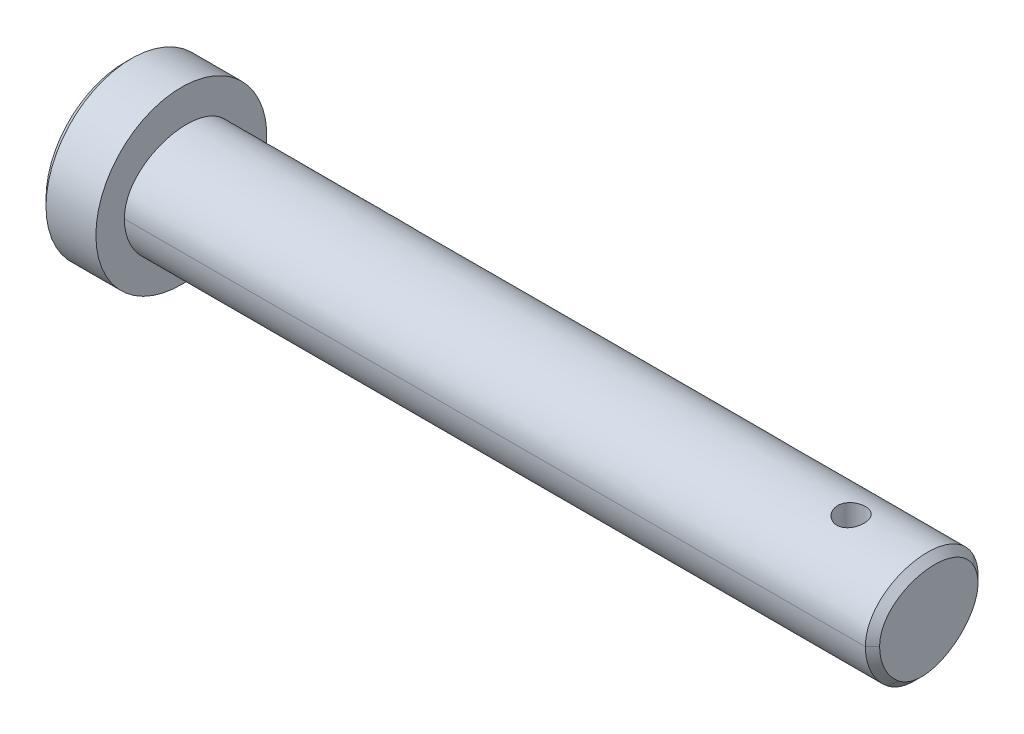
ISO-10303-21;
HEADER;
FILE_DESCRIPTION(('STEP AP214'),'2;1');
FILE_NAME('part.step','',(''),(''),'','','');
FILE_SCHEMA(('AUTOMOTIVE_DESIGN { 1 0 10303 214 1 1 1 1 }'));
ENDSEC;
DATA;
#1=APPLICATION_CONTEXT('core data for automotive mechanical design processes');
#2=APPLICATION_PROTOCOL_DEFINITION('international standard','automotive_design',2000,#1);
#3=PRODUCT_CONTEXT('',#1,'mechanical');
#4=PRODUCT('Part','Part','',(#3));
#5=PRODUCT_RELATED_PRODUCT_CATEGORY('part','',(#4));
#6=PRODUCT_DEFINITION_FORMATION('','',#4);
#7=PRODUCT_DEFINITION_CONTEXT('part definition',#1,'design');
#8=PRODUCT_DEFINITION('design','',#6,#7);
#9=PRODUCT_DEFINITION_SHAPE('','',#8);
#10=(LENGTH_UNIT() NAMED_UNIT(*) SI_UNIT(.MILLI.,.METRE.));
#11=(NAMED_UNIT(*) PLANE_ANGLE_UNIT() SI_UNIT($,.RADIAN.));
#12=(NAMED_UNIT(*) SI_UNIT($,.STERADIAN.) SOLID_ANGLE_UNIT());
#13=UNCERTAINTY_MEASURE_WITH_UNIT(LENGTH_MEASURE(1.E-05),#10,'distance_accuracy_value','');
#14=(GEOMETRIC_REPRESENTATION_CONTEXT(3) GLOBAL_UNCERTAINTY_ASSIGNED_CONTEXT((#13)) GLOBAL_UNIT_ASSIGNED_CONTEXT((#10,
#11,#12)) REPRESENTATION_CONTEXT('',''));
#15=CARTESIAN_POINT('',(0.,0.,0.));
#16=DIRECTION('',(0.,0.,1.));
#17=DIRECTION('',(1.,0.,0.));
#18=AXIS2_PLACEMENT_3D('',#15,#16,#17);
#19=CARTESIAN_POINT('',(29.9221543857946,5.99999998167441,0.));
#20=DIRECTION('',(1.,0.,0.));
#21=DIRECTION('',(0.,0.,-1.));
#22=AXIS2_PLACEMENT_3D('',#19,#20,#21);
#23=PLANE('',#22);
#24=CARTESIAN_POINT('',(29.9221543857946,-1.83255883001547E-08,0.));
#25=DIRECTION('',(-1.,0.,0.));
#26=DIRECTION('',(0.,0.,1.));
#27=AXIS2_PLACEMENT_3D('',#24,#25,#26);
#28=CIRCLE('',#27,6.);
#29=CARTESIAN_POINT('',(29.9221543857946,-1.83255883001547E-08,6.));
#30=VERTEX_POINT('',#29);
#31=EDGE_CURVE('E90',#30,#30,#28,.T.);
#32=ORIENTED_EDGE('',*,*,#31,.F.);
#33=EDGE_LOOP('',(#32));
#34=FACE_BOUND('',#33,.T.);
#35=CARTESIAN_POINT('',(29.9221543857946,-3.15938553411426,2.4532187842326));
#36=CARTESIAN_POINT('',(29.9221543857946,-5.35609051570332,-0.375814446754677));
#37=CARTESIAN_POINT('',(29.9221543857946,-1.45805539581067,-5.16749629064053));
#38=CARTESIAN_POINT('',(29.9221543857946,1.75885247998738,-3.59255327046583));
#39=B_SPLINE_CURVE_WITH_KNOTS('',3,(#35,#36,#37,#38),.UNSPECIFIED.,.F.,.F.,(4,4),(0.,1.),.UNSPECIFIED.);
#40=CARTESIAN_POINT('',(29.9221543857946,-3.15938553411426,2.4532187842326));
#41=VERTEX_POINT('',#40);
#42=CARTESIAN_POINT('',(29.9221543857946,1.75885247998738,-3.59255327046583));
#43=VERTEX_POINT('',#42);
#44=EDGE_CURVE('E86',#41,#43,#39,.T.);
#45=ORIENTED_EDGE('',*,*,#44,.F.);
#46=CARTESIAN_POINT('',(29.9221543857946,-1.8325571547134E-08,3.99999984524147));
#47=CARTESIAN_POINT('',(29.9221543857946,-1.21407798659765,3.99999984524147));
#48=CARTESIAN_POINT('',(29.9221543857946,-2.41478576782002,3.41215387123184));
#49=CARTESIAN_POINT('',(29.9221543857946,-3.15938553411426,2.4532187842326));
#50=B_SPLINE_CURVE_WITH_KNOTS('',3,(#46,#47,#48,#49),.UNSPECIFIED.,.F.,.F.,(4,4),(0.,1.),.UNSPECIFIED.);
#51=CARTESIAN_POINT('',(29.9221543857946,-1.8325571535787E-08,3.99999984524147));
#52=VERTEX_POINT('',#51);
#53=EDGE_CURVE('E94',#52,#41,#50,.T.);
#54=ORIENTED_EDGE('',*,*,#53,.F.);
#55=CARTESIAN_POINT('',(29.9221543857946,1.75885247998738,-3.59255327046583));
#56=CARTESIAN_POINT('',(29.9221543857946,4.97576035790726,-2.01761024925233));
#57=CARTESIAN_POINT('',(29.9221543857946,3.58175120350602,3.99999984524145));
#58=CARTESIAN_POINT('',(29.9221543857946,-1.8325571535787E-08,3.99999984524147));
#59=B_SPLINE_CURVE_WITH_KNOTS('',3,(#55,#56,#57,#58),.UNSPECIFIED.,.F.,.F.,(4,4),(0.,1.),.UNSPECIFIED.);
#60=EDGE_CURVE('E102',#43,#52,#59,.T.);
#61=ORIENTED_EDGE('',*,*,#60,.F.);
#62=EDGE_LOOP('',(#45,#54,#61));
#63=FACE_BOUND('',#62,.T.);
#64=ADVANCED_FACE('F33',(#34,#63),#23,.T.);
#65=CARTESIAN_POINT('',(25.9221543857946,-1.83255884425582E-08,0.));
#66=DIRECTION('',(-1.,0.,0.));
#67=DIRECTION('',(0.,0.,1.));
#68=AXIS2_PLACEMENT_3D('',#65,#66,#67);
#69=PLANE('',#68);
#70=CARTESIAN_POINT('',(25.9221543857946,-1.83255883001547E-08,0.));
#71=DIRECTION('',(-1.,0.,0.));
#72=DIRECTION('',(0.,0.,1.));
#73=AXIS2_PLACEMENT_3D('',#70,#71,#72);
#74=CIRCLE('',#73,5.49999999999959);
#75=CARTESIAN_POINT('',(25.9221543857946,-1.83255883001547E-08,5.49999999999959));
#76=VERTEX_POINT('',#75);
#77=EDGE_CURVE('E318',#76,#76,#74,.T.);
#78=ORIENTED_EDGE('',*,*,#77,.T.);
#79=EDGE_LOOP('',(#78));
#80=FACE_BOUND('',#79,.T.);
#81=ADVANCED_FACE('F358',(#80),#69,.T.);
#82=CARTESIAN_POINT('',(29.9243603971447,-1.83255883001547E-08,0.));
#83=DIRECTION('',(-1.,0.,0.));
#84=DIRECTION('',(0.,0.,1.));
#85=AXIS2_PLACEMENT_3D('',#82,#83,#84);
#86=CYLINDRICAL_SURFACE('',#85,6.);
#87=CARTESIAN_POINT('',(26.422154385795,-1.83255883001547E-08,0.));
#88=DIRECTION('',(-1.,0.,0.));
#89=DIRECTION('',(0.,0.,1.));
#90=AXIS2_PLACEMENT_3D('',#87,#88,#89);
#91=CIRCLE('',#90,6.);
#92=CARTESIAN_POINT('',(26.422154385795,-1.83255883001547E-08,6.));
#93=VERTEX_POINT('',#92);
#94=EDGE_CURVE('E315',#93,#93,#91,.F.);
#95=ORIENTED_EDGE('',*,*,#94,.T.);
#96=EDGE_LOOP('',(#95));
#97=FACE_BOUND('',#96,.T.);
#98=ORIENTED_EDGE('',*,*,#31,.T.);
#99=EDGE_LOOP('',(#98));
#100=FACE_BOUND('',#99,.T.);
#101=ADVANCED_FACE('F181',(#97,#100),#86,.T.);
#102=CARTESIAN_POINT('',(82.4221543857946,-1.8325571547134E-08,3.99999984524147));
#103=CARTESIAN_POINT('',(82.4221543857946,-1.21407798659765,3.99999984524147));
#104=CARTESIAN_POINT('',(82.4221543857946,-2.41478576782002,3.41215387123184));
#105=CARTESIAN_POINT('',(82.4221543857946,-3.15938553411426,2.4532187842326));
#106=B_SPLINE_CURVE_WITH_KNOTS('',3,(#102,#103,#104,#105),.UNSPECIFIED.,.F.,.F.,(4,4),(0.,1.),.UNSPECIFIED.);
#107=DIRECTION('',(-1.,0.,0.));
#108=VECTOR('',#107,1.);
#109=SURFACE_OF_LINEAR_EXTRUSION('',#106,#108);
#110=DIRECTION('',(-1.,0.,0.));
#111=VECTOR('',#110,1.);
#112=CARTESIAN_POINT('',(82.4221543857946,-3.15938553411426,2.4532187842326));
#113=LINE('',#112,#111);
#114=CARTESIAN_POINT('',(81.9221543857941,-3.15938553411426,2.4532187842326));
#115=VERTEX_POINT('',#114);
#116=EDGE_CURVE('E82',#115,#41,#113,.T.);
#117=ORIENTED_EDGE('',*,*,#116,.F.);
#118=CARTESIAN_POINT('',(81.9221543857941,-3.15938553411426,2.4532187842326));
#119=CARTESIAN_POINT('',(81.9221543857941,-2.41478576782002,3.41215387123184));
#120=CARTESIAN_POINT('',(81.9221543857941,-1.21407798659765,3.99999984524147));
#121=CARTESIAN_POINT('',(81.9221543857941,-1.8325571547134E-08,3.99999984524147));
#122=B_SPLINE_CURVE_WITH_KNOTS('',3,(#118,#119,#120,#121),.UNSPECIFIED.,.F.,.F.,(4,4),(0.,1.),.UNSPECIFIED.);
#123=CARTESIAN_POINT('',(81.9221543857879,-1.8325571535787E-08,3.99999984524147));
#124=VERTEX_POINT('',#123);
#125=EDGE_CURVE('E11',#115,#124,#122,.T.);
#126=ORIENTED_EDGE('',*,*,#125,.T.);
#127=DIRECTION('',(-1.,0.,0.));
#128=VECTOR('',#127,1.);
#129=CARTESIAN_POINT('',(82.4221543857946,-1.8325571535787E-08,3.99999984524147));
#130=LINE('',#129,#128);
#131=EDGE_CURVE('E97',#124,#52,#130,.T.);
#132=ORIENTED_EDGE('',*,*,#131,.T.);
#133=ORIENTED_EDGE('',*,*,#53,.T.);
#134=EDGE_LOOP('',(#117,#126,#132,#133));
#135=FACE_BOUND('',#134,.T.);
#136=ADVANCED_FACE('F95',(#135),#109,.F.);
#137=CARTESIAN_POINT('',(82.4221543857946,-3.15938553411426,2.4532187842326));
#138=CARTESIAN_POINT('',(82.4221543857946,-5.35609051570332,-0.375814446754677));
#139=CARTESIAN_POINT('',(82.4221543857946,-1.45805539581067,-5.16749629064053));
#140=CARTESIAN_POINT('',(82.4221543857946,1.75885247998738,-3.59255327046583));
#141=B_SPLINE_CURVE_WITH_KNOTS('',3,(#137,#138,#139,#140),.UNSPECIFIED.,.F.,.F.,(4,4),(0.,1.),.UNSPECIFIED.);
#142=DIRECTION('',(-1.,0.,0.));
#143=VECTOR('',#142,1.);
#144=SURFACE_OF_LINEAR_EXTRUSION('',#141,#143);
#145=CARTESIAN_POINT('',(76.9221543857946,-3.77064733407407,0.999999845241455));
#146=CARTESIAN_POINT('',(76.9781732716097,-3.77064827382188,0.999998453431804));
#147=CARTESIAN_POINT('',(77.0342078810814,-3.77130203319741,0.995278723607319));
#148=CARTESIAN_POINT('',(77.1446909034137,-3.77377094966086,0.976534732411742));
#149=CARTESIAN_POINT('',(77.199138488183,-3.77558670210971,0.962505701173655));
#150=CARTESIAN_POINT('',(77.3048636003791,-3.77995649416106,0.92556303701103));
#151=CARTESIAN_POINT('',(77.3561429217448,-3.78251011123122,0.902654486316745));
#152=CARTESIAN_POINT('',(77.4541466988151,-3.78773352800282,0.848596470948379));
#153=CARTESIAN_POINT('',(77.5008712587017,-3.79040332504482,0.817447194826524));
#154=CARTESIAN_POINT('',(77.5887244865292,-3.79513972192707,0.747563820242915));
#155=CARTESIAN_POINT('',(77.6298205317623,-3.79720287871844,0.708788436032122));
#156=CARTESIAN_POINT('',(77.7049268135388,-3.79995129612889,0.624850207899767));
#157=CARTESIAN_POINT('',(77.7389377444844,-3.80063669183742,0.579687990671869));
#158=CARTESIAN_POINT('',(77.7985564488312,-3.79997651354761,0.484794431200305));
#159=CARTESIAN_POINT('',(77.8242489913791,-3.79865226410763,0.435116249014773));
#160=CARTESIAN_POINT('',(77.8669739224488,-3.79356588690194,0.332286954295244));
#161=CARTESIAN_POINT('',(77.8840076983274,-3.78980414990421,0.279136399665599));
#162=CARTESIAN_POINT('',(77.9087393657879,-3.77976101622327,0.172072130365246));
#163=CARTESIAN_POINT('',(77.9166171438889,-3.7735315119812,0.118194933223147));
#164=CARTESIAN_POINT('',(77.923565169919,-3.75864867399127,0.0102134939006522));
#165=CARTESIAN_POINT('',(77.9226349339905,-3.74999520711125,-0.0438907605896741));
#166=CARTESIAN_POINT('',(77.9121110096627,-3.73049130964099,-0.151455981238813));
#167=CARTESIAN_POINT('',(77.902422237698,-3.71961778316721,-0.204903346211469));
#168=CARTESIAN_POINT('',(77.8746784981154,-3.69627265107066,-0.309212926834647));
#169=CARTESIAN_POINT('',(77.8566215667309,-3.683800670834,-0.360074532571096));
#170=CARTESIAN_POINT('',(77.8117155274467,-3.65735430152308,-0.460246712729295));
#171=CARTESIAN_POINT('',(77.7845090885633,-3.64333765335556,-0.509385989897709));
#172=CARTESIAN_POINT('',(77.7222404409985,-3.61514466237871,-0.602500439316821));
#173=CARTESIAN_POINT('',(77.6871624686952,-3.60096805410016,-0.646464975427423));
#174=CARTESIAN_POINT('',(77.6086914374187,-3.57296918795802,-0.729406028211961));
#175=CARTESIAN_POINT('',(77.5650598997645,-3.55917455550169,-0.768167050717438));
#176=CARTESIAN_POINT('',(77.4714359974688,-3.53357181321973,-0.83766322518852));
#177=CARTESIAN_POINT('',(77.4214577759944,-3.52175941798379,-0.868415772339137));
#178=CARTESIAN_POINT('',(77.3178780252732,-3.50142980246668,-0.920139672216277));
#179=CARTESIAN_POINT('',(77.2644204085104,-3.49282824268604,-0.941364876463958));
#180=CARTESIAN_POINT('',(77.1542363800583,-3.47928240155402,-0.974392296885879));
#181=CARTESIAN_POINT('',(77.0975119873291,-3.47433588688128,-0.986200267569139));
#182=CARTESIAN_POINT('',(76.9868281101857,-3.46881676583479,-0.99934835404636));
#183=CARTESIAN_POINT('',(76.9329648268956,-3.46795405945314,-1.00138290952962));
#184=CARTESIAN_POINT('',(76.8256829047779,-3.4698929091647,-0.996782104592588));
#185=CARTESIAN_POINT('',(76.7722641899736,-3.47269382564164,-0.990148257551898));
#186=CARTESIAN_POINT('',(76.669162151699,-3.48155165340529,-0.96885398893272));
#187=CARTESIAN_POINT('',(76.6194139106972,-3.48750052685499,-0.95445961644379));
#188=CARTESIAN_POINT('',(76.5230739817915,-3.50209741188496,-0.918358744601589));
#189=CARTESIAN_POINT('',(76.4764828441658,-3.51074589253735,-0.89665097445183));
#190=CARTESIAN_POINT('',(76.385624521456,-3.53051136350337,-0.845556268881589));
#191=CARTESIAN_POINT('',(76.3415363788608,-3.54171656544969,-0.815885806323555));
#192=CARTESIAN_POINT('',(76.2587539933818,-3.56559021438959,-0.750134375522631));
#193=CARTESIAN_POINT('',(76.220070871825,-3.57826158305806,-0.71404052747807));
#194=CARTESIAN_POINT('',(76.1464496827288,-3.60515559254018,-0.633607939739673));
#195=CARTESIAN_POINT('',(76.1119660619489,-3.61942466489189,-0.588867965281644));
#196=CARTESIAN_POINT('',(76.0510244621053,-3.64771056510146,-0.494261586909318));
#197=CARTESIAN_POINT('',(76.0245537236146,-3.66172776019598,-0.444403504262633));
#198=CARTESIAN_POINT('',(75.979633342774,-3.6890556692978,-0.339149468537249));
#199=CARTESIAN_POINT('',(75.9614431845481,-3.70233337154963,-0.283633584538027));
#200=CARTESIAN_POINT('',(75.934958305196,-3.72688154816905,-0.16986118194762));
#201=CARTESIAN_POINT('',(75.9266612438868,-3.73815249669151,-0.111605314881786));
#202=CARTESIAN_POINT('',(75.9205460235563,-3.75772740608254,0.0039507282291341));
#203=CARTESIAN_POINT('',(75.9223878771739,-3.76611772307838,0.0612180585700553));
#204=CARTESIAN_POINT('',(75.9359103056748,-3.78012274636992,0.174921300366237));
#205=CARTESIAN_POINT('',(75.9475879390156,-3.78573828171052,0.231357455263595));
#206=CARTESIAN_POINT('',(75.9797947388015,-3.79400892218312,0.339081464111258));
#207=CARTESIAN_POINT('',(75.9999016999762,-3.79678593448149,0.390486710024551));
#208=CARTESIAN_POINT('',(76.0483292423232,-3.80009532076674,0.489345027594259));
#209=CARTESIAN_POINT('',(76.0766495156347,-3.80062777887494,0.536798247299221));
#210=CARTESIAN_POINT('',(76.1404831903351,-3.7999563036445,0.626085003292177));
#211=CARTESIAN_POINT('',(76.1759471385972,-3.7987639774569,0.667954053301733));
#212=CARTESIAN_POINT('',(76.2532117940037,-3.79530642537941,0.745322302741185));
#213=CARTESIAN_POINT('',(76.2950136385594,-3.79304100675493,0.780820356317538));
#214=CARTESIAN_POINT('',(76.3847767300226,-3.78808295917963,0.845186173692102));
#215=CARTESIAN_POINT('',(76.4328497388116,-3.78538229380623,0.873897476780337));
#216=CARTESIAN_POINT('',(76.5331061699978,-3.78029593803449,0.922903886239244));
#217=CARTESIAN_POINT('',(76.5852876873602,-3.77791010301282,0.943202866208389));
#218=CARTESIAN_POINT('',(76.6847058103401,-3.77429327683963,0.972579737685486));
#219=CARTESIAN_POINT('',(76.7315920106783,-3.77294638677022,0.982841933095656));
#220=CARTESIAN_POINT('',(76.8263664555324,-3.77112302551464,0.996552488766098));
#221=CARTESIAN_POINT('',(76.8742546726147,-3.77064653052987,1.0000010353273));
#222=CARTESIAN_POINT('',(76.9221543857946,-3.77064733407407,0.999999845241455));
#223=B_SPLINE_CURVE_WITH_KNOTS('',3,(#145,#146,#147,#148,#149,#150,#151,#152,#153,#154,#155,
#156,#157,#158,#159,#160,#161,#162,#163,#164,#165,#166,#167,#168,#169,#170,#171,#172,#173,#174,
#175,#176,#177,#178,#179,#180,#181,#182,#183,#184,#185,#186,#187,#188,#189,#190,#191,#192,#193,
#194,#195,#196,#197,#198,#199,#200,#201,#202,#203,#204,#205,#206,#207,#208,#209,#210,#211,#212,
#213,#214,#215,#216,#217,#218,#219,#220,#221,#222),.UNSPECIFIED.,.T.,.F.,(4,2,2,2,2,2,2,2,2,2,2,
2,2,2,2,2,2,2,2,2,2,2,2,2,2,2,2,2,2,2,2,2,2,2,2,2,2,2,4),(0.,0.167883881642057,
0.335853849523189,0.503727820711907,0.671597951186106,0.840403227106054,1.00919195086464,
1.17620212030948,1.34318552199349,1.50682959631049,1.67048266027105,1.83593397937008,
2.00142414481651,2.17432094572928,2.34756713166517,2.52659644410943,2.7052335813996,
2.87877808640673,3.05221646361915,3.21312836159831,3.37401217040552,3.5297019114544,
3.68541871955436,3.84765688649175,4.01022410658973,4.18421969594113,4.35793674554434,
4.5367752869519,4.71557151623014,4.88840950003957,5.06119581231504,5.22620256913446,
5.39120314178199,5.55509847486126,5.71902325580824,5.88642212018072,6.05374381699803,
6.19729914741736,6.34085055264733),.UNSPECIFIED.);
#224=CARTESIAN_POINT('',(76.9221543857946,-3.77064733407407,0.999999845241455));
#225=VERTEX_POINT('',#224);
#226=EDGE_CURVE('E100',#225,#225,#223,.T.);
#227=ORIENTED_EDGE('',*,*,#226,.T.);
#228=EDGE_LOOP('',(#227));
#229=FACE_BOUND('',#228,.T.);
#230=DIRECTION('',(-1.,0.,0.));
#231=VECTOR('',#230,1.);
#232=CARTESIAN_POINT('',(82.4221543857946,1.75885247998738,-3.59255327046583));
#233=LINE('',#232,#231);
#234=CARTESIAN_POINT('',(81.9221543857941,1.75885247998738,-3.59255327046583));
#235=VERTEX_POINT('',#234);
#236=EDGE_CURVE('E91',#235,#43,#233,.T.);
#237=ORIENTED_EDGE('',*,*,#236,.F.);
#238=CARTESIAN_POINT('',(81.9221543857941,1.75885247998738,-3.59255327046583));
#239=CARTESIAN_POINT('',(81.9221543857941,-1.45805539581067,-5.16749629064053));
#240=CARTESIAN_POINT('',(81.9221543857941,-5.35609051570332,-0.375814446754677));
#241=CARTESIAN_POINT('',(81.9221543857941,-3.15938553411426,2.4532187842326));
#242=B_SPLINE_CURVE_WITH_KNOTS('',3,(#238,#239,#240,#241),.UNSPECIFIED.,.F.,.F.,(4,4),(0.,1.),.UNSPECIFIED.);
#243=EDGE_CURVE('E46',#235,#115,#242,.T.);
#244=ORIENTED_EDGE('',*,*,#243,.T.);
#245=ORIENTED_EDGE('',*,*,#116,.T.);
#246=ORIENTED_EDGE('',*,*,#44,.T.);
#247=EDGE_LOOP('',(#237,#244,#245,#246));
#248=FACE_BOUND('',#247,.T.);
#249=ADVANCED_FACE('F84',(#229,#248),#144,.F.);
#250=CARTESIAN_POINT('',(82.4221543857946,1.75885247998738,-3.59255327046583));
#251=CARTESIAN_POINT('',(82.4221543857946,4.97576035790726,-2.01761024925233));
#252=CARTESIAN_POINT('',(82.4221543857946,3.58175120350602,3.99999984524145));
#253=CARTESIAN_POINT('',(82.4221543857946,-1.8325571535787E-08,3.99999984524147));
#254=B_SPLINE_CURVE_WITH_KNOTS('',3,(#250,#251,#252,#253),.UNSPECIFIED.,.F.,.F.,(4,4),(0.,1.),.UNSPECIFIED.);
#255=DIRECTION('',(-1.,0.,0.));
#256=VECTOR('',#255,1.);
#257=SURFACE_OF_LINEAR_EXTRUSION('',#254,#256);
#258=CARTESIAN_POINT('',(76.9221543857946,3.3768709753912,0.999999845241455));
#259=CARTESIAN_POINT('',(76.8671659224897,3.37687221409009,0.999997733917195));
#260=CARTESIAN_POINT('',(76.8121517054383,3.37812851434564,0.995447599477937));
#261=CARTESIAN_POINT('',(76.7036951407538,3.38303535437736,0.977395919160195));
#262=CARTESIAN_POINT('',(76.6502541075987,3.38668784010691,0.963887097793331));
#263=CARTESIAN_POINT('',(76.5465509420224,3.39603272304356,0.928396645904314));
#264=CARTESIAN_POINT('',(76.4962840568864,3.40172198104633,0.906428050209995));
#265=CARTESIAN_POINT('',(76.4001518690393,3.41463274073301,0.854689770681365));
#266=CARTESIAN_POINT('',(76.354287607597,3.42185460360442,0.824918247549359));
#267=CARTESIAN_POINT('',(76.2672040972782,3.4373857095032,0.75771207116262));
#268=CARTESIAN_POINT('',(76.2261018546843,3.44571451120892,0.720130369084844));
#269=CARTESIAN_POINT('',(76.1507106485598,3.46265933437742,0.638712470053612));
#270=CARTESIAN_POINT('',(76.1164227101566,3.47127539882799,0.594875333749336));
#271=CARTESIAN_POINT('',(76.0548349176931,3.48833190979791,0.500980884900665));
#272=CARTESIAN_POINT('',(76.0277181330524,3.4967634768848,0.45080164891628));
#273=CARTESIAN_POINT('',(75.9823539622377,3.5125960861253,0.346428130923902));
#274=CARTESIAN_POINT('',(75.9641062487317,3.51999716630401,0.292233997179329));
#275=CARTESIAN_POINT('',(75.9371818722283,3.53320340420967,0.181760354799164));
#276=CARTESIAN_POINT('',(75.9284348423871,3.53902005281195,0.125499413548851));
#277=CARTESIAN_POINT('',(75.9206164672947,3.54879019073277,0.0121507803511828));
#278=CARTESIAN_POINT('',(75.9215436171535,3.55274396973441,-0.0449367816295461));
#279=CARTESIAN_POINT('',(75.932977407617,3.55858812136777,-0.156920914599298));
#280=CARTESIAN_POINT('',(75.9432637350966,3.5605237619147,-0.21183770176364));
#281=CARTESIAN_POINT('',(75.9728402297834,3.56257207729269,-0.319224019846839));
#282=CARTESIAN_POINT('',(75.9921299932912,3.56268483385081,-0.371693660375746));
#283=CARTESIAN_POINT('',(76.0389657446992,3.56136731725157,-0.47226084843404));
#284=CARTESIAN_POINT('',(76.0664432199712,3.55994960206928,-0.520390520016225));
#285=CARTESIAN_POINT('',(76.1289321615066,3.55601144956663,-0.611430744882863));
#286=CARTESIAN_POINT('',(76.1639441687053,3.55349093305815,-0.654340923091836));
#287=CARTESIAN_POINT('',(76.24097338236,3.54783514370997,-0.734238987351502));
#288=CARTESIAN_POINT('',(76.2830658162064,3.54469319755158,-0.771153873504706));
#289=CARTESIAN_POINT('',(76.3728116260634,3.53839099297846,-0.837457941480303));
#290=CARTESIAN_POINT('',(76.420465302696,3.53523073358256,-0.866846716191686));
#291=CARTESIAN_POINT('',(76.5204858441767,3.52941361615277,-0.917514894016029));
#292=CARTESIAN_POINT('',(76.5728916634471,3.52676160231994,-0.938718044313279));
#293=CARTESIAN_POINT('',(76.6805605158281,3.52245567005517,-0.972012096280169));
#294=CARTESIAN_POINT('',(76.7358233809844,3.52080169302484,-0.984103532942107));
#295=CARTESIAN_POINT('',(76.8472722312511,3.51878238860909,-0.998765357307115));
#296=CARTESIAN_POINT('',(76.9034503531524,3.51840912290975,-1.00139440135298));
#297=CARTESIAN_POINT('',(77.015446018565,3.51899246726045,-0.997214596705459));
#298=CARTESIAN_POINT('',(77.0712635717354,3.51994904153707,-0.990406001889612));
#299=CARTESIAN_POINT('',(77.1806267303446,3.52302038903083,-0.96762326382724));
#300=CARTESIAN_POINT('',(77.2341834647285,3.52512853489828,-0.951701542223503));
#301=CARTESIAN_POINT('',(77.3378745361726,3.53014397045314,-0.91119464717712));
#302=CARTESIAN_POINT('',(77.3880086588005,3.53305131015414,-0.88660893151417));
#303=CARTESIAN_POINT('',(77.4838310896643,3.53919399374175,-0.829252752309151));
#304=CARTESIAN_POINT('',(77.5294843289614,3.54243157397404,-0.796423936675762));
#305=CARTESIAN_POINT('',(77.6146672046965,3.54864005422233,-0.7235792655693));
#306=CARTESIAN_POINT('',(77.6541966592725,3.55161094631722,-0.683563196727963));
#307=CARTESIAN_POINT('',(77.7261800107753,3.55672027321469,-0.597255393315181));
#308=CARTESIAN_POINT('',(77.7586022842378,3.55885501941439,-0.55093703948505));
#309=CARTESIAN_POINT('',(77.8152039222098,3.56175992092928,-0.453472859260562));
#310=CARTESIAN_POINT('',(77.8393840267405,3.56253019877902,-0.40232746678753));
#311=CARTESIAN_POINT('',(77.8785706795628,3.56233038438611,-0.297280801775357));
#312=CARTESIAN_POINT('',(77.8936754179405,3.5613793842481,-0.243416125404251));
#313=CARTESIAN_POINT('',(77.9147017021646,3.55758762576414,-0.133990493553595));
#314=CARTESIAN_POINT('',(77.9206238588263,3.55474699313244,-0.0784296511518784));
#315=CARTESIAN_POINT('',(77.9231518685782,3.54722720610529,0.0322541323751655));
#316=CARTESIAN_POINT('',(77.9198438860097,3.54256540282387,0.0873763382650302));
#317=CARTESIAN_POINT('',(77.9042631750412,3.53161110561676,0.196170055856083));
#318=CARTESIAN_POINT('',(77.8919898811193,3.52531850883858,0.249841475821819));
#319=CARTESIAN_POINT('',(77.858695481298,3.51139663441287,0.354913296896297));
#320=CARTESIAN_POINT('',(77.8375738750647,3.50375260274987,0.406279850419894));
#321=CARTESIAN_POINT('',(77.7872013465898,3.48770169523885,0.504729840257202));
#322=CARTESIAN_POINT('',(77.7579493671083,3.47929472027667,0.551812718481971));
#323=CARTESIAN_POINT('',(77.6913435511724,3.46213871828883,0.641513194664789));
#324=CARTESIAN_POINT('',(77.6538196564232,3.45338626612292,0.684003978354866));
#325=CARTESIAN_POINT('',(77.5720771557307,3.43643862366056,0.762098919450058));
#326=CARTESIAN_POINT('',(77.5278589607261,3.42824339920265,0.797703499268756));
#327=CARTESIAN_POINT('',(77.4336815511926,3.4130869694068,0.86114919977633));
#328=CARTESIAN_POINT('',(77.3836979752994,3.40613134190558,0.888955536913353));
#329=CARTESIAN_POINT('',(77.279558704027,3.39415945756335,0.935687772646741));
#330=CARTESIAN_POINT('',(77.2254074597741,3.38914116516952,0.954622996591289));
#331=CARTESIAN_POINT('',(77.1295962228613,3.38256772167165,0.97913697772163));
#332=CARTESIAN_POINT('',(77.0885315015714,3.38044245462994,0.986945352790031));
#333=CARTESIAN_POINT('',(77.0057009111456,3.37759365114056,0.997377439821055));
#334=CARTESIAN_POINT('',(76.9639350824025,3.37687003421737,1.00000144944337));
#335=CARTESIAN_POINT('',(76.9221543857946,3.3768709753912,0.999999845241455));
#336=B_SPLINE_CURVE_WITH_KNOTS('',3,(#258,#259,#260,#261,#262,#263,#264,#265,#266,#267,#268,
#269,#270,#271,#272,#273,#274,#275,#276,#277,#278,#279,#280,#281,#282,#283,#284,#285,#286,#287,
#288,#289,#290,#291,#292,#293,#294,#295,#296,#297,#298,#299,#300,#301,#302,#303,#304,#305,#306,
#307,#308,#309,#310,#311,#312,#313,#314,#315,#316,#317,#318,#319,#320,#321,#322,#323,#324,#325,
#326,#327,#328,#329,#330,#331,#332,#333,#334,#335),.UNSPECIFIED.,.T.,.F.,(4,2,2,2,2,2,2,2,2,2,2,
2,2,2,2,2,2,2,2,2,2,2,2,2,2,2,2,2,2,2,2,2,2,2,2,2,2,2,4),(0.,0.164810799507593,
0.329755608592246,0.494447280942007,0.659177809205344,0.827348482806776,0.99554443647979,
1.16769131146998,1.33983183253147,1.51068851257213,1.68151861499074,1.84842860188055,
2.01533110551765,2.18087446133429,2.34642970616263,2.51387010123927,2.68131955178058,
2.8502932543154,3.0192570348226,3.18717160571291,3.35508165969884,3.52203541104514,
3.6889996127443,3.8571808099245,4.02536700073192,4.19428699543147,4.36319181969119,
4.53023464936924,4.69726636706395,4.86274405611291,5.02823218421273,5.19565321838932,
5.36309603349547,5.53436996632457,5.70563338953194,5.87764899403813,6.04948336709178,
6.17471518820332,6.29993981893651),.UNSPECIFIED.);
#337=CARTESIAN_POINT('',(76.9221543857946,3.3768709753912,0.999999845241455));
#338=VERTEX_POINT('',#337);
#339=EDGE_CURVE('E340',#338,#338,#336,.T.);
#340=ORIENTED_EDGE('',*,*,#339,.T.);
#341=EDGE_LOOP('',(#340));
#342=FACE_BOUND('',#341,.T.);
#343=ORIENTED_EDGE('',*,*,#131,.F.);
#344=CARTESIAN_POINT('',(81.9221543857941,-1.8325571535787E-08,3.99999984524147));
#345=CARTESIAN_POINT('',(81.9221543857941,3.58175120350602,3.99999984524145));
#346=CARTESIAN_POINT('',(81.9221543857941,4.97576035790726,-2.01761024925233));
#347=CARTESIAN_POINT('',(81.9221543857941,1.75885247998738,-3.59255327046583));
#348=B_SPLINE_CURVE_WITH_KNOTS('',3,(#344,#345,#346,#347),.UNSPECIFIED.,.F.,.F.,(4,4),(0.,1.),.UNSPECIFIED.);
#349=EDGE_CURVE('E134',#124,#235,#348,.T.);
#350=ORIENTED_EDGE('',*,*,#349,.T.);
#351=ORIENTED_EDGE('',*,*,#236,.T.);
#352=ORIENTED_EDGE('',*,*,#60,.T.);
#353=EDGE_LOOP('',(#343,#350,#351,#352));
#354=FACE_BOUND('',#353,.T.);
#355=ADVANCED_FACE('F138',(#342,#354),#257,.F.);
#356=CARTESIAN_POINT('',(82.4221543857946,-1.75574710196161,3.58620997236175));
#357=DIRECTION('',(-1.,0.,0.));
#358=DIRECTION('',(0.,0.,1.));
#359=AXIS2_PLACEMENT_3D('',#356,#357,#358);
#360=PLANE('',#359);
#361=CARTESIAN_POINT('',(82.4221543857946,1.53899591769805,-3.143484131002));
#362=CARTESIAN_POINT('',(82.4221543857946,1.45564383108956,-3.18429128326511));
#363=CARTESIAN_POINT('',(82.4221543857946,1.37082202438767,-3.22049024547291));
#364=CARTESIAN_POINT('',(82.4221543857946,1.2413231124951,-3.26768319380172));
#365=CARTESIAN_POINT('',(82.4221543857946,1.19777903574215,-3.28222970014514));
#366=CARTESIAN_POINT('',(82.4221543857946,1.109923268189,-3.30891592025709));
#367=CARTESIAN_POINT('',(82.4221543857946,1.06561159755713,-3.32105569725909));
#368=CARTESIAN_POINT('',(82.4221543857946,0.976207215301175,-3.34288635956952));
#369=CARTESIAN_POINT('',(82.4221543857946,0.931103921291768,-3.35257765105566));
#370=CARTESIAN_POINT('',(82.4221543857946,0.840143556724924,-3.36946248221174));
#371=CARTESIAN_POINT('',(82.4221543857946,0.79413840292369,-3.37666565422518));
#372=CARTESIAN_POINT('',(82.4221543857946,0.702507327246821,-3.38839288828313));
#373=CARTESIAN_POINT('',(82.4221543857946,0.656667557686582,-3.39296225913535));
#374=CARTESIAN_POINT('',(82.4221543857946,0.565063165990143,-3.39956502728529));
#375=CARTESIAN_POINT('',(82.4221543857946,0.519277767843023,-3.40160277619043));
#376=CARTESIAN_POINT('',(82.4221543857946,0.381970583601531,-3.40402914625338));
#377=CARTESIAN_POINT('',(82.4221543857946,0.290487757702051,-3.40073340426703));
#378=CARTESIAN_POINT('',(82.4221543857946,0.153387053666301,-3.38875723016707));
#379=CARTESIAN_POINT('',(82.4221543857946,0.107680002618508,-3.38358678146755));
#380=CARTESIAN_POINT('',(82.4221543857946,0.0163563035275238,-3.37094926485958));
#381=CARTESIAN_POINT('',(82.4221543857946,-0.0293955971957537,-3.36345625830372));
#382=CARTESIAN_POINT('',(82.4221543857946,-0.120421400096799,-3.34627932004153));
#383=CARTESIAN_POINT('',(82.4221543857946,-0.165504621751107,-3.33663973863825));
#384=CARTESIAN_POINT('',(82.4221543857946,-0.255007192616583,-3.31534260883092));
#385=CARTESIAN_POINT('',(82.4221543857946,-0.299400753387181,-3.30369008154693));
#386=CARTESIAN_POINT('',(82.4221543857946,-0.431561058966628,-3.2658687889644));
#387=CARTESIAN_POINT('',(82.4221543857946,-0.518309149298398,-3.23684114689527));
#388=CARTESIAN_POINT('',(82.4221543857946,-0.646554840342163,-3.18803339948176));
#389=CARTESIAN_POINT('',(82.4221543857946,-0.688989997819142,-3.17088456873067));
#390=CARTESIAN_POINT('',(82.4221543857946,-0.773253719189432,-3.13488448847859));
#391=CARTESIAN_POINT('',(82.4221543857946,-0.815082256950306,-3.1160331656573));
#392=CARTESIAN_POINT('',(82.4221543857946,-0.898148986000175,-3.07667369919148));
#393=CARTESIAN_POINT('',(82.4221543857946,-0.939382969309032,-3.05616711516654));
#394=CARTESIAN_POINT('',(82.4221543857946,-1.02129006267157,-3.01352636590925));
#395=CARTESIAN_POINT('',(82.4221543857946,-1.06195614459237,-2.99139019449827));
#396=CARTESIAN_POINT('',(82.4221543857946,-1.18215179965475,-2.92314830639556));
#397=CARTESIAN_POINT('',(82.4221543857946,-1.26020195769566,-2.8750747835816));
#398=CARTESIAN_POINT('',(82.4221543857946,-1.41249134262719,-2.77417296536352));
#399=CARTESIAN_POINT('',(82.4221543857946,-1.48672813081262,-2.72134699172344));
#400=CARTESIAN_POINT('',(82.4221543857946,-1.63161536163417,-2.61123056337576));
#401=CARTESIAN_POINT('',(82.4221543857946,-1.70226479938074,-2.55393885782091));
#402=CARTESIAN_POINT('',(82.4221543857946,-1.8401129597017,-2.43505980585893));
#403=CARTESIAN_POINT('',(82.4221543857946,-1.90731121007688,-2.37347187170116));
#404=CARTESIAN_POINT('',(82.4221543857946,-2.03831482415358,-2.24607235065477));
#405=CARTESIAN_POINT('',(82.4221543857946,-2.10211055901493,-2.18026840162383));
#406=CARTESIAN_POINT('',(82.4221543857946,-2.19527651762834,-2.07835705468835));
#407=CARTESIAN_POINT('',(82.4221543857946,-2.2259426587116,-2.04380747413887));
#408=CARTESIAN_POINT('',(82.4221543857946,-2.28607143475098,-1.97403906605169));
#409=CARTESIAN_POINT('',(82.4221543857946,-2.31557573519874,-1.93877844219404));
#410=CARTESIAN_POINT('',(82.4221543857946,-2.40231857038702,-1.83200044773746));
#411=CARTESIAN_POINT('',(82.4221543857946,-2.45792073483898,-1.75934816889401));
#412=CARTESIAN_POINT('',(82.4221543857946,-2.56459741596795,-1.61127044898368));
#413=CARTESIAN_POINT('',(82.4221543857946,-2.61569255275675,-1.53582333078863));
#414=CARTESIAN_POINT('',(82.4221543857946,-2.71334159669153,-1.38207816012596));
#415=CARTESIAN_POINT('',(82.4221543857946,-2.75989794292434,-1.30378163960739));
#416=CARTESIAN_POINT('',(82.4221543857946,-2.84831713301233,-1.14424206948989));
#417=CARTESIAN_POINT('',(82.4221543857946,-2.8901807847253,-1.06299952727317));
#418=CARTESIAN_POINT('',(82.4221543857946,-2.94925756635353,-0.938801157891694));
#419=CARTESIAN_POINT('',(82.4221543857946,-2.96833319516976,-0.896998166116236));
#420=CARTESIAN_POINT('',(82.4221543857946,-3.00517540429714,-0.812636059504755));
#421=CARTESIAN_POINT('',(82.4221543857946,-3.02299096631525,-0.769950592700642));
#422=CARTESIAN_POINT('',(82.4221543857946,-3.0570857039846,-0.684219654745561));
#423=CARTESIAN_POINT('',(82.4221543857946,-3.07336662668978,-0.641183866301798));
#424=CARTESIAN_POINT('',(82.4221543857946,-3.10438259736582,-0.5547297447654));
#425=CARTESIAN_POINT('',(82.4221543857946,-3.11911570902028,-0.511317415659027));
#426=CARTESIAN_POINT('',(82.4221543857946,-3.16093965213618,-0.380512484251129));
#427=CARTESIAN_POINT('',(82.4221543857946,-3.18566072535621,-0.292553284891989));
#428=CARTESIAN_POINT('',(82.4221543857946,-3.22838836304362,-0.115029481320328));
#429=CARTESIAN_POINT('',(82.4221543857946,-3.24639746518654,-0.0254654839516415));
#430=CARTESIAN_POINT('',(82.4221543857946,-3.26794040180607,0.110188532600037));
#431=CARTESIAN_POINT('',(82.4221543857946,-3.27420846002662,0.155624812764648));
#432=CARTESIAN_POINT('',(82.4221543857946,-3.28482250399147,0.246956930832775));
#433=CARTESIAN_POINT('',(82.4221543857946,-3.28916656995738,0.292826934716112));
#434=CARTESIAN_POINT('',(82.4221543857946,-3.29582834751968,0.385156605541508));
#435=CARTESIAN_POINT('',(82.4221543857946,-3.29812452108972,0.431414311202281));
#436=CARTESIAN_POINT('',(82.4221543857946,-3.30056560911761,0.523513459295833));
#437=CARTESIAN_POINT('',(82.4221543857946,-3.30071971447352,0.569477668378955));
#438=CARTESIAN_POINT('',(82.4221543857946,-3.2979016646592,0.706968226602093));
#439=CARTESIAN_POINT('',(82.4221543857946,-3.29166177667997,0.798189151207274));
#440=CARTESIAN_POINT('',(82.4221543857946,-3.27537327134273,0.934282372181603));
#441=CARTESIAN_POINT('',(82.4221543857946,-3.26878793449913,0.979525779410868));
#442=CARTESIAN_POINT('',(82.4221543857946,-3.25322353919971,1.06976200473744));
#443=CARTESIAN_POINT('',(82.4221543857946,-3.2442445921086,1.11475483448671));
#444=CARTESIAN_POINT('',(82.4221543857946,-3.22379873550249,1.20448003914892));
#445=CARTESIAN_POINT('',(82.4221543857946,-3.21234006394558,1.24918332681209));
#446=CARTESIAN_POINT('',(82.4221543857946,-3.18679394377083,1.33843450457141));
#447=CARTESIAN_POINT('',(82.4221543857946,-3.17282206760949,1.38255963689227));
#448=CARTESIAN_POINT('',(82.4221543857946,-3.14260450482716,1.4695289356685));
#449=CARTESIAN_POINT('',(82.4221543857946,-3.12634274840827,1.51242928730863));
#450=CARTESIAN_POINT('',(82.4221543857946,-3.09155172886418,1.59705825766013));
#451=CARTESIAN_POINT('',(82.4221543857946,-3.07302142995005,1.63879015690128));
#452=CARTESIAN_POINT('',(82.4221543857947,-3.01406842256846,1.76225979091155));
#453=CARTESIAN_POINT('',(82.4221543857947,-2.97028477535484,1.84227206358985));
#454=CARTESIAN_POINT('',(82.4221543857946,-2.87393189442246,1.99778620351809));
#455=CARTESIAN_POINT('',(82.4221543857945,-2.82136174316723,2.07328759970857));
#456=CARTESIAN_POINT('',(82.4221543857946,-2.7644623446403,2.14656641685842));
#457=B_SPLINE_CURVE_WITH_KNOTS('',3,(#361,#362,#363,#364,#365,#366,#367,#368,#369,#370,#371,
#372,#373,#374,#375,#376,#377,#378,#379,#380,#381,#382,#383,#384,#385,#386,#387,#388,#389,#390,
#391,#392,#393,#394,#395,#396,#397,#398,#399,#400,#401,#402,#403,#404,#405,#406,#407,#408,#409,
#410,#411,#412,#413,#414,#415,#416,#417,#418,#419,#420,#421,#422,#423,#424,#425,#426,#427,#428,
#429,#430,#431,#432,#433,#434,#435,#436,#437,#438,#439,#440,#441,#442,#443,#444,#445,#446,#447,
#448,#449,#450,#451,#452,#453,#454,#455,#456),.UNSPECIFIED.,.F.,.F.,(4,2,2,2,2,2,2,2,2,2,2,2,2,
2,2,2,2,2,2,2,2,2,2,2,2,2,2,2,2,2,2,2,2,2,2,2,2,2,2,2,2,2,2,2,2,2,2,4),(0.,0.000273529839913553,
0.000410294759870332,0.000547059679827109,0.000683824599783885,0.000820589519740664,
0.00095735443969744,0.00109411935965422,0.00136764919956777,0.00150441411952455,
0.00164117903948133,0.0017779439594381,0.00191470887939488,0.00218823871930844,
0.00232500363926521,0.00246176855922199,0.00259853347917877,0.00273529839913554,
0.0030088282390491,0.00328235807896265,0.00355588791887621,0.00382941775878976,
0.00410294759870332,0.0042397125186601,0.00437647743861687,0.00465000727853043,
0.00492353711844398,0.00519706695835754,0.00547059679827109,0.00560736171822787,
0.00574412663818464,0.00588089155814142,0.0060176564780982,0.00629118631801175,
0.00656471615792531,0.00670148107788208,0.00683824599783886,0.00697501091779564,
0.00711177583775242,0.00738530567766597,0.00752207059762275,0.00765883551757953,
0.0077956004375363,0.00793236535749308,0.00806913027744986,0.00820589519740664,
0.00847942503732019,0.00875295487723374),.UNSPECIFIED.);
#458=CARTESIAN_POINT('',(82.4221543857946,-2.7644623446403,2.14656641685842));
#459=VERTEX_POINT('',#458);
#460=CARTESIAN_POINT('',(82.4221543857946,1.53899591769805,-3.143484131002));
#461=VERTEX_POINT('',#460);
#462=EDGE_CURVE('E304',#459,#461,#457,.F.);
#463=ORIENTED_EDGE('',*,*,#462,.T.);
#464=CARTESIAN_POINT('',(82.4221543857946,-1.83255741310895E-08,3.499999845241));
#465=CARTESIAN_POINT('',(82.4221543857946,0.0928051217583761,3.49999930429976));
#466=CARTESIAN_POINT('',(82.4221543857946,0.184903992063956,3.49521371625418));
#467=CARTESIAN_POINT('',(82.4221543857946,0.321963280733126,3.48065713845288));
#468=CARTESIAN_POINT('',(82.4221543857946,0.367468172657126,3.47457501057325));
#469=CARTESIAN_POINT('',(82.4221543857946,0.458109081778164,3.45991159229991));
#470=CARTESIAN_POINT('',(82.4221543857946,0.503245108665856,3.45133036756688));
#471=CARTESIAN_POINT('',(82.4221543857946,0.593141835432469,3.43162504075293));
#472=CARTESIAN_POINT('',(82.4221543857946,0.637912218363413,3.42049665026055));
#473=CARTESIAN_POINT('',(82.4221543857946,0.727031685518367,3.39566509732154));
#474=CARTESIAN_POINT('',(82.4221543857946,0.771518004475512,3.38190547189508));
#475=CARTESIAN_POINT('',(82.4221543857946,0.85897199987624,3.35214676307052));
#476=CARTESIAN_POINT('',(82.4221543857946,0.902151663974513,3.33609434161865));
#477=CARTESIAN_POINT('',(82.4221543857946,0.987328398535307,3.30174488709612));
#478=CARTESIAN_POINT('',(82.4221543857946,1.02934604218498,3.2834426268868));
#479=CARTESIAN_POINT('',(82.4221543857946,1.15373378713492,3.22524607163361));
#480=CARTESIAN_POINT('',(82.4221543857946,1.23444883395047,3.18205984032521));
#481=CARTESIAN_POINT('',(82.4221543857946,1.35231814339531,3.11101860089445));
#482=CARTESIAN_POINT('',(82.4221543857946,1.39109588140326,3.08627683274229));
#483=CARTESIAN_POINT('',(82.4221543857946,1.46756030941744,3.03477036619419));
#484=CARTESIAN_POINT('',(82.4221543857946,1.50535706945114,3.00792289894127));
#485=CARTESIAN_POINT('',(82.4221543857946,1.57955790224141,2.95247039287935));
#486=CARTESIAN_POINT('',(82.4221543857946,1.61581021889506,2.92398903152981));
#487=CARTESIAN_POINT('',(82.4221543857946,1.68683127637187,2.86550580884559));
#488=CARTESIAN_POINT('',(82.4221543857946,1.72157906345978,2.83551979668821));
#489=CARTESIAN_POINT('',(82.4221543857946,1.82364677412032,2.74343842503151));
#490=CARTESIAN_POINT('',(82.4221543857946,1.88879471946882,2.67922331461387));
#491=CARTESIAN_POINT('',(82.4221543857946,1.98251567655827,2.57899589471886));
#492=CARTESIAN_POINT('',(82.4221543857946,2.01308774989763,2.54493457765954));
#493=CARTESIAN_POINT('',(82.4221543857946,2.07293851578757,2.4755496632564));
#494=CARTESIAN_POINT('',(82.4221543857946,2.1022171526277,2.44022601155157));
#495=CARTESIAN_POINT('',(82.4221543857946,2.15951568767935,2.36835023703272));
#496=CARTESIAN_POINT('',(82.4221543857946,2.18753249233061,2.33180136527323));
#497=CARTESIAN_POINT('',(82.4221543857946,2.24234669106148,2.25748845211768));
#498=CARTESIAN_POINT('',(82.4221543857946,2.26913689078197,2.21972569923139));
#499=CARTESIAN_POINT('',(82.4221543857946,2.34708235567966,2.10558344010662));
#500=CARTESIAN_POINT('',(82.4221543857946,2.39604363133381,2.02808709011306));
#501=CARTESIAN_POINT('',(82.4221543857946,2.48845270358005,1.87049966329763));
#502=CARTESIAN_POINT('',(82.4221543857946,2.53189933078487,1.79041174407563));
#503=CARTESIAN_POINT('',(82.4221543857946,2.61360846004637,1.62780314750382));
#504=CARTESIAN_POINT('',(82.4221543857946,2.65186950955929,1.54528178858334));
#505=CARTESIAN_POINT('',(82.4221543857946,2.72340353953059,1.37789831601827));
#506=CARTESIAN_POINT('',(82.4221543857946,2.75667583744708,1.29303588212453));
#507=CARTESIAN_POINT('',(82.4221543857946,2.81831595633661,1.12100948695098));
#508=CARTESIAN_POINT('',(82.4221543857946,2.84667848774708,1.03385661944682));
#509=CARTESIAN_POINT('',(82.4221543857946,2.88554264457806,0.901359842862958));
#510=CARTESIAN_POINT('',(82.4221543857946,2.89789317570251,0.856845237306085));
#511=CARTESIAN_POINT('',(82.4221543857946,2.92121904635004,0.767744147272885));
#512=CARTESIAN_POINT('',(82.4221543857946,2.9322134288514,0.723101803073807));
#513=CARTESIAN_POINT('',(82.4221543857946,2.96316880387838,0.589058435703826));
#514=CARTESIAN_POINT('',(82.4221543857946,2.98116107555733,0.499357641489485));
#515=CARTESIAN_POINT('',(82.4221543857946,3.01185976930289,0.319456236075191));
#516=CARTESIAN_POINT('',(82.4221543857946,3.02457517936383,0.22922708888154));
#517=CARTESIAN_POINT('',(82.4221543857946,3.04467375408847,0.0482050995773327));
#518=CARTESIAN_POINT('',(82.4221543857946,3.05205978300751,-0.0425874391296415));
#519=CARTESIAN_POINT('',(82.4221543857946,3.06132079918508,-0.224755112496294));
#520=CARTESIAN_POINT('',(82.4221543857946,3.06319673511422,-0.316130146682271));
#521=CARTESIAN_POINT('',(82.4221543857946,3.06164420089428,-0.453654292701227));
#522=CARTESIAN_POINT('',(82.4221543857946,3.06039542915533,-0.49958696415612));
#523=CARTESIAN_POINT('',(82.4221543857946,3.05638970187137,-0.591555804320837));
#524=CARTESIAN_POINT('',(82.4221543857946,3.05362118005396,-0.637726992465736));
#525=CARTESIAN_POINT('',(82.4221543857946,3.04654595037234,-0.729717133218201));
#526=CARTESIAN_POINT('',(82.4221543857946,3.04224506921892,-0.775528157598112));
#527=CARTESIAN_POINT('',(82.4221543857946,3.03208668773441,-0.86681404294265));
#528=CARTESIAN_POINT('',(82.4221543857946,3.02623008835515,-0.912282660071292));
#529=CARTESIAN_POINT('',(82.4221543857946,3.00627712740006,-1.04815411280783));
#530=CARTESIAN_POINT('',(82.4221543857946,2.98980325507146,-1.13802381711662));
#531=CARTESIAN_POINT('',(82.4221543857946,2.95011903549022,-1.31625264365));
#532=CARTESIAN_POINT('',(82.4221543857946,2.92691123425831,-1.40461233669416));
#533=CARTESIAN_POINT('',(82.4221543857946,2.88661091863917,-1.53592111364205));
#534=CARTESIAN_POINT('',(82.4221543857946,2.87226157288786,-1.57948532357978));
#535=CARTESIAN_POINT('',(82.4221543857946,2.84163452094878,-1.66618132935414));
#536=CARTESIAN_POINT('',(82.4221543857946,2.82536645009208,-1.70928907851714));
#537=CARTESIAN_POINT('',(82.4221543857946,2.7907510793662,-1.79514316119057));
#538=CARTESIAN_POINT('',(82.4221543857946,2.77247324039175,-1.83769863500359));
#539=CARTESIAN_POINT('',(82.4221543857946,2.73416847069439,-1.92148978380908));
#540=CARTESIAN_POINT('',(82.4221543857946,2.71409581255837,-1.96283976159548));
#541=CARTESIAN_POINT('',(82.4221543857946,2.65110841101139,-2.08508616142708));
#542=CARTESIAN_POINT('',(82.4221543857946,2.60539309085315,-2.16427140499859));
#543=CARTESIAN_POINT('',(82.4221543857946,2.53092178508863,-2.27933966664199));
#544=CARTESIAN_POINT('',(82.4221543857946,2.50511312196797,-2.317078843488));
#545=CARTESIAN_POINT('',(82.4221543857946,2.45145609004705,-2.39127958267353));
#546=CARTESIAN_POINT('',(82.4221543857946,2.42360781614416,-2.42774120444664));
#547=CARTESIAN_POINT('',(82.4221543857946,2.3657912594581,-2.49933653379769));
#548=CARTESIAN_POINT('',(82.4221543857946,2.33584316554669,-2.53444773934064));
#549=CARTESIAN_POINT('',(82.4221543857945,2.27365430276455,-2.6033746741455));
#550=CARTESIAN_POINT('',(82.4221543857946,2.24170322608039,-2.63686152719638));
#551=CARTESIAN_POINT('',(82.4221543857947,2.17632213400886,-2.70168492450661));
#552=CARTESIAN_POINT('',(82.4221543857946,2.14285298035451,-2.73306486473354));
#553=CARTESIAN_POINT('',(82.4221543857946,2.07439336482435,-2.79377531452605));
#554=CARTESIAN_POINT('',(82.4221543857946,2.03940053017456,-2.82310831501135));
#555=CARTESIAN_POINT('',(82.4221543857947,1.93216135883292,-2.90807870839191));
#556=CARTESIAN_POINT('',(82.4221543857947,1.85765514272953,-2.96068854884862));
#557=CARTESIAN_POINT('',(82.4221543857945,1.70273532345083,-3.0579941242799));
#558=CARTESIAN_POINT('',(82.4221543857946,1.6223211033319,-3.10268903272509));
#559=CARTESIAN_POINT('',(82.4221543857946,1.53899591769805,-3.143484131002));
#560=B_SPLINE_CURVE_WITH_KNOTS('',3,(#464,#465,#466,#467,#468,#469,#470,#471,#472,#473,#474,
#475,#476,#477,#478,#479,#480,#481,#482,#483,#484,#485,#486,#487,#488,#489,#490,#491,#492,#493,
#494,#495,#496,#497,#498,#499,#500,#501,#502,#503,#504,#505,#506,#507,#508,#509,#510,#511,#512,
#513,#514,#515,#516,#517,#518,#519,#520,#521,#522,#523,#524,#525,#526,#527,#528,#529,#530,#531,
#532,#533,#534,#535,#536,#537,#538,#539,#540,#541,#542,#543,#544,#545,#546,#547,#548,#549,#550,
#551,#552,#553,#554,#555,#556,#557,#558,#559),.UNSPECIFIED.,.F.,.F.,(4,2,2,2,2,2,2,2,2,2,2,2,2,
2,2,2,2,2,2,2,2,2,2,2,2,2,2,2,2,2,2,2,2,2,2,2,2,2,2,2,2,2,2,2,2,2,2,4),(0.,0.000273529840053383,
0.000410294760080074,0.000547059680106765,0.000683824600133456,0.000820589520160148,
0.000957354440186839,0.00109411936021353,0.00136764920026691,0.00150441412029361,
0.0016411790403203,0.00177794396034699,0.00191470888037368,0.00218823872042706,
0.00232500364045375,0.00246176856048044,0.00259853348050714,0.00273529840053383,
0.00300882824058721,0.00328235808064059,0.00355588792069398,0.00382941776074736,
0.00410294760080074,0.00423971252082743,0.00437647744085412,0.00465000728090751,
0.00492353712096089,0.00519706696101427,0.00547059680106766,0.00560736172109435,
0.00574412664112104,0.00588089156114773,0.00601765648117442,0.0062911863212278,
0.00656471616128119,0.00670148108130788,0.00683824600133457,0.00697501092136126,
0.00711177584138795,0.00738530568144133,0.00752207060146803,0.00765883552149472,
0.00779560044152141,0.0079323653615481,0.00806913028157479,0.00820589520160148,
0.00847942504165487,0.00875295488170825),.UNSPECIFIED.);
#561=CARTESIAN_POINT('',(82.4221543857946,-1.83255749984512E-08,3.499999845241));
#562=VERTEX_POINT('',#561);
#563=EDGE_CURVE('E312',#461,#562,#560,.F.);
#564=ORIENTED_EDGE('',*,*,#563,.T.);
#565=CARTESIAN_POINT('',(82.4221543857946,-2.7644623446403,2.14656641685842));
#566=CARTESIAN_POINT('',(82.4221543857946,-2.68240972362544,2.25222512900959));
#567=CARTESIAN_POINT('',(82.4221543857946,-2.59467684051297,2.35186421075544));
#568=CARTESIAN_POINT('',(82.4221543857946,-2.45516384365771,2.49293635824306));
#569=CARTESIAN_POINT('',(82.4221543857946,-2.40733710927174,2.5385589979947));
#570=CARTESIAN_POINT('',(82.4221543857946,-2.30909119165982,2.62705694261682));
#571=CARTESIAN_POINT('',(82.4221543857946,-2.25867195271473,2.66993218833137));
#572=CARTESIAN_POINT('',(82.4221543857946,-2.15526076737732,2.75295626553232));
#573=CARTESIAN_POINT('',(82.4221543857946,-2.10228464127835,2.79309273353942));
#574=CARTESIAN_POINT('',(82.4221543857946,-2.02083424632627,2.85127995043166));
#575=CARTESIAN_POINT('',(82.4221543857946,-1.99334307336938,2.87034202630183));
#576=CARTESIAN_POINT('',(82.4221543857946,-1.93803540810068,2.90756220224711));
#577=CARTESIAN_POINT('',(82.4221543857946,-1.91016823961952,2.92576002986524));
#578=CARTESIAN_POINT('',(82.4221543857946,-1.76990762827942,3.01459364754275));
#579=CARTESIAN_POINT('',(82.4221543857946,-1.65455247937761,3.07903319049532));
#580=CARTESIAN_POINT('',(82.4221543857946,-1.47699448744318,3.16598170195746));
#581=CARTESIAN_POINT('',(82.4221543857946,-1.41704910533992,3.1933453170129));
#582=CARTESIAN_POINT('',(82.4221543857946,-1.29563365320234,3.24482148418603));
#583=CARTESIAN_POINT('',(82.4221543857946,-1.23416367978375,3.26893424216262));
#584=CARTESIAN_POINT('',(82.4221543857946,-1.10967358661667,3.31385441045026));
#585=CARTESIAN_POINT('',(82.4221543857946,-1.04664801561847,3.33466225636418));
#586=CARTESIAN_POINT('',(82.4221543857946,-0.950928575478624,3.36331944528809));
#587=CARTESIAN_POINT('',(82.4221543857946,-0.918783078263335,3.37245495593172));
#588=CARTESIAN_POINT('',(82.4221543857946,-0.85427218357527,3.38980796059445));
#589=CARTESIAN_POINT('',(82.4221543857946,-0.821959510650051,3.39801298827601));
#590=CARTESIAN_POINT('',(82.4221543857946,-0.724863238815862,3.42120872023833));
#591=CARTESIAN_POINT('',(82.4221543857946,-0.659833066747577,3.43481087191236));
#592=CARTESIAN_POINT('',(82.4221543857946,-0.529295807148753,3.45823585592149));
#593=CARTESIAN_POINT('',(82.4221543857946,-0.46376803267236,3.46806512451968));
#594=CARTESIAN_POINT('',(82.4221543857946,-0.266393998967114,3.49180678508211));
#595=CARTESIAN_POINT('',(82.4221543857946,-0.133759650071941,3.49999207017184));
#596=CARTESIAN_POINT('',(82.4221543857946,-1.83255745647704E-08,3.499999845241));
#597=B_SPLINE_CURVE_WITH_KNOTS('',3,(#565,#566,#567,#568,#569,#570,#571,#572,#573,#574,#575,
#576,#577,#578,#579,#580,#581,#582,#583,#584,#585,#586,#587,#588,#589,#590,#591,#592,#593,#594,
#595,#596),.UNSPECIFIED.,.F.,.F.,(4,2,2,2,2,2,2,2,2,2,2,2,2,2,2,4),(0.,0.000397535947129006,
0.00059630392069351,0.000795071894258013,0.000993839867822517,0.00109322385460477,
0.00119260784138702,0.00159014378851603,0.00178891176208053,0.00198767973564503,
0.00218644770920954,0.00228583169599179,0.00238521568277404,0.00258398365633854,
0.00278275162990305,0.00318028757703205),.UNSPECIFIED.);
#598=EDGE_CURVE('E293',#562,#459,#597,.F.);
#599=ORIENTED_EDGE('',*,*,#598,.T.);
#600=EDGE_LOOP('',(#463,#564,#599));
#601=FACE_BOUND('',#600,.T.);
#602=ADVANCED_FACE('F147',(#601),#360,.F.);
#603=CARTESIAN_POINT('',(76.9221543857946,4.00009746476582,-1.54758532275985E-07));
#604=DIRECTION('',(0.,1.,0.));
#605=DIRECTION('',(0.,0.,1.));
#606=AXIS2_PLACEMENT_3D('',#603,#604,#605);
#607=CYLINDRICAL_SURFACE('',#606,0.999999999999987);
#608=ORIENTED_EDGE('',*,*,#339,.F.);
#609=EDGE_LOOP('',(#608));
#610=FACE_BOUND('',#609,.T.);
#611=ORIENTED_EDGE('',*,*,#226,.F.);
#612=EDGE_LOOP('',(#611));
#613=FACE_BOUND('',#612,.T.);
#614=ADVANCED_FACE('F345',(#610,#613),#607,.F.);
#615=CARTESIAN_POINT('',(25.9221543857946,-1.83255883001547E-08,0.));
#616=DIRECTION('',(1.,0.,0.));
#617=DIRECTION('',(0.,0.,-1.));
#618=AXIS2_PLACEMENT_3D('',#615,#616,#617);
#619=CONICAL_SURFACE('',#618,5.49999999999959,0.78539816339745);
#620=ORIENTED_EDGE('',*,*,#94,.F.);
#621=EDGE_LOOP('',(#620));
#622=FACE_BOUND('',#621,.T.);
#623=ORIENTED_EDGE('',*,*,#77,.F.);
#624=EDGE_LOOP('',(#623));
#625=FACE_BOUND('',#624,.T.);
#626=ADVANCED_FACE('F215',(#622,#625),#619,.T.);
#627=CARTESIAN_POINT('',(82.4221543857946,-2.7644623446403,2.14656641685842));
#628=CARTESIAN_POINT('',(82.4221543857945,-2.82136174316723,2.07328759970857));
#629=CARTESIAN_POINT('',(82.4221543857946,-2.87393189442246,1.99778620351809));
#630=CARTESIAN_POINT('',(82.4221543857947,-2.97028477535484,1.84227206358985));
#631=CARTESIAN_POINT('',(82.4221543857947,-3.01406842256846,1.76225979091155));
#632=CARTESIAN_POINT('',(82.4221543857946,-3.07302142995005,1.63879015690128));
#633=CARTESIAN_POINT('',(82.4221543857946,-3.09155172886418,1.59705825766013));
#634=CARTESIAN_POINT('',(82.4221543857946,-3.12634274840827,1.51242928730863));
#635=CARTESIAN_POINT('',(82.4221543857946,-3.14260450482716,1.4695289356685));
#636=CARTESIAN_POINT('',(82.4221543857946,-3.17282206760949,1.38255963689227));
#637=CARTESIAN_POINT('',(82.4221543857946,-3.18679394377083,1.33843450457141));
#638=CARTESIAN_POINT('',(82.4221543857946,-3.21234006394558,1.24918332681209));
#639=CARTESIAN_POINT('',(82.4221543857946,-3.22379873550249,1.20448003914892));
#640=CARTESIAN_POINT('',(82.4221543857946,-3.2442445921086,1.11475483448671));
#641=CARTESIAN_POINT('',(82.4221543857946,-3.25322353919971,1.06976200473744));
#642=CARTESIAN_POINT('',(82.4221543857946,-3.26878793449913,0.979525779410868));
#643=CARTESIAN_POINT('',(82.4221543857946,-3.27537327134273,0.934282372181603));
#644=CARTESIAN_POINT('',(82.4221543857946,-3.29166177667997,0.798189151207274));
#645=CARTESIAN_POINT('',(82.4221543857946,-3.2979016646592,0.706968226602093));
#646=CARTESIAN_POINT('',(82.4221543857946,-3.30071971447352,0.569477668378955));
#647=CARTESIAN_POINT('',(82.4221543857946,-3.30056560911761,0.523513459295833));
#648=CARTESIAN_POINT('',(82.4221543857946,-3.29812452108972,0.431414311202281));
#649=CARTESIAN_POINT('',(82.4221543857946,-3.29582834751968,0.385156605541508));
#650=CARTESIAN_POINT('',(82.4221543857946,-3.28916656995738,0.292826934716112));
#651=CARTESIAN_POINT('',(82.4221543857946,-3.28482250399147,0.246956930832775));
#652=CARTESIAN_POINT('',(82.4221543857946,-3.27420846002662,0.155624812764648));
#653=CARTESIAN_POINT('',(82.4221543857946,-3.26794040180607,0.110188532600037));
#654=CARTESIAN_POINT('',(82.4221543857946,-3.24639746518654,-0.0254654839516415));
#655=CARTESIAN_POINT('',(82.4221543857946,-3.22838836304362,-0.115029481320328));
#656=CARTESIAN_POINT('',(82.4221543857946,-3.18566072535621,-0.292553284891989));
#657=CARTESIAN_POINT('',(82.4221543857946,-3.16093965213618,-0.380512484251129));
#658=CARTESIAN_POINT('',(82.4221543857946,-3.11911570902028,-0.511317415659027));
#659=CARTESIAN_POINT('',(82.4221543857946,-3.10438259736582,-0.5547297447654));
#660=CARTESIAN_POINT('',(82.4221543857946,-3.07336662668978,-0.641183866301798));
#661=CARTESIAN_POINT('',(82.4221543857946,-3.0570857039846,-0.684219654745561));
#662=CARTESIAN_POINT('',(82.4221543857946,-3.02299096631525,-0.769950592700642));
#663=CARTESIAN_POINT('',(82.4221543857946,-3.00517540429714,-0.812636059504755));
#664=CARTESIAN_POINT('',(82.4221543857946,-2.96833319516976,-0.896998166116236));
#665=CARTESIAN_POINT('',(82.4221543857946,-2.94925756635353,-0.938801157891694));
#666=CARTESIAN_POINT('',(82.4221543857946,-2.8901807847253,-1.06299952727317));
#667=CARTESIAN_POINT('',(82.4221543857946,-2.84831713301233,-1.14424206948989));
#668=CARTESIAN_POINT('',(82.4221543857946,-2.75989794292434,-1.30378163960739));
#669=CARTESIAN_POINT('',(82.4221543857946,-2.71334159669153,-1.38207816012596));
#670=CARTESIAN_POINT('',(82.4221543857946,-2.61569255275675,-1.53582333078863));
#671=CARTESIAN_POINT('',(82.4221543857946,-2.56459741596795,-1.61127044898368));
#672=CARTESIAN_POINT('',(82.4221543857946,-2.45792073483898,-1.75934816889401));
#673=CARTESIAN_POINT('',(82.4221543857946,-2.40231857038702,-1.83200044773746));
#674=CARTESIAN_POINT('',(82.4221543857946,-2.31557573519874,-1.93877844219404));
#675=CARTESIAN_POINT('',(82.4221543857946,-2.28607143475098,-1.97403906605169));
#676=CARTESIAN_POINT('',(82.4221543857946,-2.2259426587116,-2.04380747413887));
#677=CARTESIAN_POINT('',(82.4221543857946,-2.19527651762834,-2.07835705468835));
#678=CARTESIAN_POINT('',(82.4221543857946,-2.10211055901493,-2.18026840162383));
#679=CARTESIAN_POINT('',(82.4221543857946,-2.03831482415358,-2.24607235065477));
#680=CARTESIAN_POINT('',(82.4221543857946,-1.90731121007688,-2.37347187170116));
#681=CARTESIAN_POINT('',(82.4221543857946,-1.8401129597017,-2.43505980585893));
#682=CARTESIAN_POINT('',(82.4221543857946,-1.70226479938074,-2.55393885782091));
#683=CARTESIAN_POINT('',(82.4221543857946,-1.63161536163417,-2.61123056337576));
#684=CARTESIAN_POINT('',(82.4221543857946,-1.48672813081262,-2.72134699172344));
#685=CARTESIAN_POINT('',(82.4221543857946,-1.41249134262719,-2.77417296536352));
#686=CARTESIAN_POINT('',(82.4221543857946,-1.26020195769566,-2.8750747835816));
#687=CARTESIAN_POINT('',(82.4221543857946,-1.18215179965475,-2.92314830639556));
#688=CARTESIAN_POINT('',(82.4221543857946,-1.06195614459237,-2.99139019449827));
#689=CARTESIAN_POINT('',(82.4221543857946,-1.02129006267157,-3.01352636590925));
#690=CARTESIAN_POINT('',(82.4221543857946,-0.939382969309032,-3.05616711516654));
#691=CARTESIAN_POINT('',(82.4221543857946,-0.898148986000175,-3.07667369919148));
#692=CARTESIAN_POINT('',(82.4221543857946,-0.815082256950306,-3.1160331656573));
#693=CARTESIAN_POINT('',(82.4221543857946,-0.773253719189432,-3.13488448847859));
#694=CARTESIAN_POINT('',(82.4221543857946,-0.688989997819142,-3.17088456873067));
#695=CARTESIAN_POINT('',(82.4221543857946,-0.646554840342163,-3.18803339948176));
#696=CARTESIAN_POINT('',(82.4221543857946,-0.518309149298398,-3.23684114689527));
#697=CARTESIAN_POINT('',(82.4221543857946,-0.431561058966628,-3.2658687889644));
#698=CARTESIAN_POINT('',(82.4221543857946,-0.299400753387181,-3.30369008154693));
#699=CARTESIAN_POINT('',(82.4221543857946,-0.255007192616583,-3.31534260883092));
#700=CARTESIAN_POINT('',(82.4221543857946,-0.165504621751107,-3.33663973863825));
#701=CARTESIAN_POINT('',(82.4221543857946,-0.120421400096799,-3.34627932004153));
#702=CARTESIAN_POINT('',(82.4221543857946,-0.0293955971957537,-3.36345625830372));
#703=CARTESIAN_POINT('',(82.4221543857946,0.0163563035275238,-3.37094926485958));
#704=CARTESIAN_POINT('',(82.4221543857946,0.107680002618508,-3.38358678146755));
#705=CARTESIAN_POINT('',(82.4221543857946,0.153387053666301,-3.38875723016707));
#706=CARTESIAN_POINT('',(82.4221543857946,0.290487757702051,-3.40073340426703));
#707=CARTESIAN_POINT('',(82.4221543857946,0.381970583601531,-3.40402914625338));
#708=CARTESIAN_POINT('',(82.4221543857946,0.519277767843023,-3.40160277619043));
#709=CARTESIAN_POINT('',(82.4221543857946,0.565063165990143,-3.39956502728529));
#710=CARTESIAN_POINT('',(82.4221543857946,0.656667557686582,-3.39296225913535));
#711=CARTESIAN_POINT('',(82.4221543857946,0.702507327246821,-3.38839288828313));
#712=CARTESIAN_POINT('',(82.4221543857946,0.79413840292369,-3.37666565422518));
#713=CARTESIAN_POINT('',(82.4221543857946,0.840143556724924,-3.36946248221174));
#714=CARTESIAN_POINT('',(82.4221543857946,0.931103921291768,-3.35257765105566));
#715=CARTESIAN_POINT('',(82.4221543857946,0.976207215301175,-3.34288635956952));
#716=CARTESIAN_POINT('',(82.4221543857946,1.06561159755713,-3.32105569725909));
#717=CARTESIAN_POINT('',(82.4221543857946,1.109923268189,-3.30891592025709));
#718=CARTESIAN_POINT('',(82.4221543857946,1.19777903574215,-3.28222970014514));
#719=CARTESIAN_POINT('',(82.4221543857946,1.2413231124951,-3.26768319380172));
#720=CARTESIAN_POINT('',(82.4221543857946,1.37082202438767,-3.22049024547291));
#721=CARTESIAN_POINT('',(82.4221543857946,1.45564383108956,-3.18429128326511));
#722=CARTESIAN_POINT('',(82.4221543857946,1.53899591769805,-3.143484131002));
#723=CARTESIAN_POINT('',(81.9221543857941,-3.15938553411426,2.4532187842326));
#724=CARTESIAN_POINT('',(81.9221543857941,-3.2268304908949,2.36636058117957));
#725=CARTESIAN_POINT('',(81.9221543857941,-3.28951172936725,2.27638139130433));
#726=CARTESIAN_POINT('',(81.9221543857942,-3.40476866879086,2.09035671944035));
#727=CARTESIAN_POINT('',(81.9221543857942,-3.45734103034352,1.99431211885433));
#728=CARTESIAN_POINT('',(81.9221543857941,-3.52819377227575,1.84592038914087));
#729=CARTESIAN_POINT('',(81.9221543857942,-3.5504771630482,1.79573697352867));
#730=CARTESIAN_POINT('',(81.9221543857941,-3.59231148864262,1.69397519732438));
#731=CARTESIAN_POINT('',(81.9221543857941,-3.61186350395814,1.64239314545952));
#732=CARTESIAN_POINT('',(81.9221543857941,-3.64817111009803,1.53789604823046));
#733=CARTESIAN_POINT('',(81.9221543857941,-3.66494595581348,1.4849138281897));
#734=CARTESIAN_POINT('',(81.9221543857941,-3.69558079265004,1.37788394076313));
#735=CARTESIAN_POINT('',(81.9221543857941,-3.70930234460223,1.32434353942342));
#736=CARTESIAN_POINT('',(81.9221543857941,-3.73374744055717,1.21706785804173));
#737=CARTESIAN_POINT('',(81.9221543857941,-3.74446125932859,1.16336750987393));
#738=CARTESIAN_POINT('',(81.9221543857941,-3.76299859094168,1.05589526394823));
#739=CARTESIAN_POINT('',(81.9221543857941,-3.77082220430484,1.00212326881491));
#740=CARTESIAN_POINT('',(81.9221543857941,-3.79013460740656,0.840762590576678));
#741=CARTESIAN_POINT('',(81.9221543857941,-3.797470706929,0.73312318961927));
#742=CARTESIAN_POINT('',(81.9221543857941,-3.80077783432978,0.57176292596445));
#743=CARTESIAN_POINT('',(81.9221543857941,-3.80059410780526,0.517963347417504));
#744=CARTESIAN_POINT('',(81.9221543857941,-3.79774465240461,0.410457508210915));
#745=CARTESIAN_POINT('',(81.9221543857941,-3.79506835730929,0.356608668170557));
#746=CARTESIAN_POINT('',(81.9221543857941,-3.78733427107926,0.249417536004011));
#747=CARTESIAN_POINT('',(81.9221543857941,-3.78230156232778,0.196308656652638));
#748=CARTESIAN_POINT('',(81.9221543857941,-3.770044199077,0.0908360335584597));
#749=CARTESIAN_POINT('',(81.9221543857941,-3.76282174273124,0.0385021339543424));
#750=CARTESIAN_POINT('',(81.9221543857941,-3.73806945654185,-0.11736127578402));
#751=CARTESIAN_POINT('',(81.9221543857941,-3.71746111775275,-0.219754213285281));
#752=CARTESIAN_POINT('',(81.9221543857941,-3.66882307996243,-0.421834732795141));
#753=CARTESIAN_POINT('',(81.9221543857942,-3.64078979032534,-0.521522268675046));
#754=CARTESIAN_POINT('',(81.9221543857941,-3.59356202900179,-0.669227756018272));
#755=CARTESIAN_POINT('',(81.9221543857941,-3.57695450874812,-0.718158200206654));
#756=CARTESIAN_POINT('',(81.9221543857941,-3.54205458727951,-0.815438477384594));
#757=CARTESIAN_POINT('',(81.9221543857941,-3.52376435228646,-0.863781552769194));
#758=CARTESIAN_POINT('',(81.9221543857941,-3.48552273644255,-0.959939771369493));
#759=CARTESIAN_POINT('',(81.9221543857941,-3.46556958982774,-1.00774362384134));
#760=CARTESIAN_POINT('',(81.9221543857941,-3.42436481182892,-1.10209523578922));
#761=CARTESIAN_POINT('',(81.9221543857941,-3.40305824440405,-1.14878485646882));
#762=CARTESIAN_POINT('',(81.9221543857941,-3.33715246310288,-1.28733942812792));
#763=CARTESIAN_POINT('',(81.9221543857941,-3.29055414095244,-1.37775649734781));
#764=CARTESIAN_POINT('',(81.9221543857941,-3.19231510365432,-1.55501465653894));
#765=CARTESIAN_POINT('',(81.9221543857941,-3.14067335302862,-1.64185482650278));
#766=CARTESIAN_POINT('',(81.9221543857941,-3.03248787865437,-1.81218980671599));
#767=CARTESIAN_POINT('',(81.9221543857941,-2.97594115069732,-1.89568201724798));
#768=CARTESIAN_POINT('',(81.9221543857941,-2.8579535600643,-2.05946040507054));
#769=CARTESIAN_POINT('',(81.9221543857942,-2.79648991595,-2.13977019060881));
#770=CARTESIAN_POINT('',(81.9221543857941,-2.70060453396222,-2.25780238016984));
#771=CARTESIAN_POINT('',(81.9221543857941,-2.66799068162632,-2.29677931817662));
#772=CARTESIAN_POINT('',(81.9221543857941,-2.60151552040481,-2.37391154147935));
#773=CARTESIAN_POINT('',(81.9221543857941,-2.56760809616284,-2.41211309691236));
#774=CARTESIAN_POINT('',(81.9221543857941,-2.4645657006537,-2.52482799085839));
#775=CARTESIAN_POINT('',(81.9221543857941,-2.39396918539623,-2.59765041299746));
#776=CARTESIAN_POINT('',(81.9221543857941,-2.24883344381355,-2.73879324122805));
#777=CARTESIAN_POINT('',(81.9221543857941,-2.17430509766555,-2.80710515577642));
#778=CARTESIAN_POINT('',(81.9221543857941,-2.0211527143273,-2.93918238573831));
#779=CARTESIAN_POINT('',(81.9221543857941,-1.94252952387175,-3.00294845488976));
#780=CARTESIAN_POINT('',(81.9221543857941,-1.78090559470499,-3.12578494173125));
#781=CARTESIAN_POINT('',(81.9221543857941,-1.69790637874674,-3.18485703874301));
#782=CARTESIAN_POINT('',(81.9221543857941,-1.52712017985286,-3.2980141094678));
#783=CARTESIAN_POINT('',(81.9221543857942,-1.43933596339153,-3.35209715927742));
#784=CARTESIAN_POINT('',(81.9221543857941,-1.30363804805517,-3.42914055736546));
#785=CARTESIAN_POINT('',(81.9221543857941,-1.25764258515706,-3.45417982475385));
#786=CARTESIAN_POINT('',(81.9221543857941,-1.16481127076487,-3.50250772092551));
#787=CARTESIAN_POINT('',(81.9221543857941,-1.11798384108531,-3.52579835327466));
#788=CARTESIAN_POINT('',(81.9221543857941,-1.02344103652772,-3.57059552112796));
#789=CARTESIAN_POINT('',(81.9221543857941,-0.975730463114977,-3.59210027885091));
#790=CARTESIAN_POINT('',(81.9221543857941,-0.879391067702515,-3.63325946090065));
#791=CARTESIAN_POINT('',(81.9221543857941,-0.830762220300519,-3.65291399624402));
#792=CARTESIAN_POINT('',(81.9221543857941,-0.683432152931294,-3.70898489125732));
#793=CARTESIAN_POINT('',(81.9221543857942,-0.583289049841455,-3.74251917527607));
#794=CARTESIAN_POINT('',(81.9221543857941,-0.429888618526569,-3.78641891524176));
#795=CARTESIAN_POINT('',(81.9221543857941,-0.378223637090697,-3.7999834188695));
#796=CARTESIAN_POINT('',(81.9221543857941,-0.27377515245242,-3.82483693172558));
#797=CARTESIAN_POINT('',(81.9221543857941,-0.221021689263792,-3.83612005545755));
#798=CARTESIAN_POINT('',(81.9221543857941,-0.114217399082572,-3.85627449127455));
#799=CARTESIAN_POINT('',(81.9221543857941,-0.0603891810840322,-3.86509375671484));
#800=CARTESIAN_POINT('',(81.9221543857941,0.0473365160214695,-3.88000102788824));
#801=CARTESIAN_POINT('',(81.9221543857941,0.101392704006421,-3.88611930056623));
#802=CARTESIAN_POINT('',(81.9221543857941,0.263928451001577,-3.90031753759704));
#803=CARTESIAN_POINT('',(81.9221543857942,0.372909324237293,-3.90426708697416));
#804=CARTESIAN_POINT('',(81.9221543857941,0.537059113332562,-3.9013667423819));
#805=CARTESIAN_POINT('',(81.9221543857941,0.591890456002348,-3.89892849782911));
#806=CARTESIAN_POINT('',(81.9221543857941,0.701732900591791,-3.89101116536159));
#807=CARTESIAN_POINT('',(81.9221543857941,0.756768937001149,-3.88552659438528));
#808=CARTESIAN_POINT('',(81.9221543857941,0.866861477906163,-3.87143662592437));
#809=CARTESIAN_POINT('',(81.9221543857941,0.92217499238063,-3.86277663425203));
#810=CARTESIAN_POINT('',(81.9221543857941,1.03154953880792,-3.84247361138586));
#811=CARTESIAN_POINT('',(81.9221543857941,1.08578801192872,-3.83081908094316));
#812=CARTESIAN_POINT('',(81.9221543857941,1.19324052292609,-3.80458144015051));
#813=CARTESIAN_POINT('',(81.9221543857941,1.24646708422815,-3.78999793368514));
#814=CARTESIAN_POINT('',(81.9221543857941,1.35187362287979,-3.75798064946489));
#815=CARTESIAN_POINT('',(81.9221543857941,1.40405342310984,-3.7405470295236));
#816=CARTESIAN_POINT('',(81.9221543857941,1.55896142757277,-3.68409398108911));
#817=CARTESIAN_POINT('',(81.9221543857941,1.66005409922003,-3.64092379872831));
#818=CARTESIAN_POINT('',(81.9221543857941,1.75885247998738,-3.59255327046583));
#819=B_SPLINE_SURFACE_WITH_KNOTS('',1,3,((#627,#628,#629,#630,#631,#632,#633,#634,#635,#636,
#637,#638,#639,#640,#641,#642,#643,#644,#645,#646,#647,#648,#649,#650,#651,#652,#653,#654,#655,
#656,#657,#658,#659,#660,#661,#662,#663,#664,#665,#666,#667,#668,#669,#670,#671,#672,#673,#674,
#675,#676,#677,#678,#679,#680,#681,#682,#683,#684,#685,#686,#687,#688,#689,#690,#691,#692,#693,
#694,#695,#696,#697,#698,#699,#700,#701,#702,#703,#704,#705,#706,#707,#708,#709,#710,#711,#712,
#713,#714,#715,#716,#717,#718,#719,#720,#721,#722),(#723,#724,#725,#726,#727,#728,#729,#730,
#731,#732,#733,#734,#735,#736,#737,#738,#739,#740,#741,#742,#743,#744,#745,#746,#747,#748,#749,
#750,#751,#752,#753,#754,#755,#756,#757,#758,#759,#760,#761,#762,#763,#764,#765,#766,#767,#768,
#769,#770,#771,#772,#773,#774,#775,#776,#777,#778,#779,#780,#781,#782,#783,#784,#785,#786,#787,
#788,#789,#790,#791,#792,#793,#794,#795,#796,#797,#798,#799,#800,#801,#802,#803,#804,#805,#806,
#807,#808,#809,#810,#811,#812,#813,#814,#815,#816,#817,#818)),.UNSPECIFIED.,.F.,.F.,.F.,(2,2),
(4,2,2,2,2,2,2,2,2,2,2,2,2,2,2,2,2,2,2,2,2,2,2,2,2,2,2,2,2,2,2,2,2,2,2,2,2,2,2,2,2,2,2,2,2,2,2,
4),(0.,1.),(0.,0.000273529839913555,0.000547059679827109,0.000683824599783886,
0.000820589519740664,0.000957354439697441,0.00109411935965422,0.001230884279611,
0.00136764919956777,0.00164117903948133,0.0017779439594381,0.00191470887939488,
0.00205147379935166,0.00218823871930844,0.00246176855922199,0.00273529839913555,
0.00287206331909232,0.0030088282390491,0.00314559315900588,0.00328235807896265,
0.00355588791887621,0.00382941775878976,0.00410294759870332,0.00437647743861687,
0.00451324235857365,0.00465000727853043,0.00492353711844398,0.00519706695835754,
0.00547059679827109,0.00574412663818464,0.0060176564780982,0.00615442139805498,
0.00629118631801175,0.00642795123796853,0.00656471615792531,0.00683824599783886,
0.00697501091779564,0.00711177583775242,0.00724854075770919,0.00738530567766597,
0.00765883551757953,0.0077956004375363,0.00793236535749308,0.00806913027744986,
0.00820589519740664,0.00834266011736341,0.00847942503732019,0.00875295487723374),.UNSPECIFIED.);
#820=CARTESIAN_POINT('',(82.4221543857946,1.53899591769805,-3.143484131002));
#821=CARTESIAN_POINT('',(81.9221543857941,1.75885247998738,-3.59255327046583));
#822=B_SPLINE_CURVE_WITH_KNOTS('',1,(#820,#821),.UNSPECIFIED.,.F.,.F.,(2,2),(0.,1.),.UNSPECIFIED.);
#823=EDGE_CURVE('E61',#461,#235,#822,.T.);
#824=CARTESIAN_POINT('',(81.9221543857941,-3.15938553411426,2.4532187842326));
#825=CARTESIAN_POINT('',(82.4221543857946,-2.7644623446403,2.14656641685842));
#826=B_SPLINE_CURVE_WITH_KNOTS('',1,(#824,#825),.UNSPECIFIED.,.F.,.F.,(2,2),(0.,1.),.UNSPECIFIED.);
#827=EDGE_CURVE('E274',#115,#459,#826,.T.);
#828=ORIENTED_EDGE('',*,*,#823,.F.);
#829=ORIENTED_EDGE('',*,*,#462,.F.);
#830=ORIENTED_EDGE('',*,*,#827,.F.);
#831=ORIENTED_EDGE('',*,*,#243,.F.);
#832=EDGE_LOOP('',(#828,#829,#830,#831));
#833=FACE_BOUND('',#832,.T.);
#834=ADVANCED_FACE('F35',(#833),#819,.T.);
#835=CARTESIAN_POINT('',(82.4221543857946,-1.83255745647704E-08,3.499999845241));
#836=CARTESIAN_POINT('',(82.4221543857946,-0.133759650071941,3.49999207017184));
#837=CARTESIAN_POINT('',(82.4221543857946,-0.266393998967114,3.49180678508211));
#838=CARTESIAN_POINT('',(82.4221543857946,-0.46376803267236,3.46806512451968));
#839=CARTESIAN_POINT('',(82.4221543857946,-0.529295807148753,3.45823585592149));
#840=CARTESIAN_POINT('',(82.4221543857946,-0.659833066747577,3.43481087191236));
#841=CARTESIAN_POINT('',(82.4221543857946,-0.724863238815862,3.42120872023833));
#842=CARTESIAN_POINT('',(82.4221543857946,-0.821959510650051,3.39801298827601));
#843=CARTESIAN_POINT('',(82.4221543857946,-0.85427218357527,3.38980796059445));
#844=CARTESIAN_POINT('',(82.4221543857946,-0.918783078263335,3.37245495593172));
#845=CARTESIAN_POINT('',(82.4221543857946,-0.950928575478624,3.36331944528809));
#846=CARTESIAN_POINT('',(82.4221543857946,-1.04664801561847,3.33466225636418));
#847=CARTESIAN_POINT('',(82.4221543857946,-1.10967358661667,3.31385441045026));
#848=CARTESIAN_POINT('',(82.4221543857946,-1.23416367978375,3.26893424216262));
#849=CARTESIAN_POINT('',(82.4221543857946,-1.29563365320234,3.24482148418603));
#850=CARTESIAN_POINT('',(82.4221543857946,-1.41704910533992,3.1933453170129));
#851=CARTESIAN_POINT('',(82.4221543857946,-1.47699448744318,3.16598170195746));
#852=CARTESIAN_POINT('',(82.4221543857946,-1.65455247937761,3.07903319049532));
#853=CARTESIAN_POINT('',(82.4221543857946,-1.76990762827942,3.01459364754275));
#854=CARTESIAN_POINT('',(82.4221543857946,-1.91016823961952,2.92576002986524));
#855=CARTESIAN_POINT('',(82.4221543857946,-1.93803540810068,2.90756220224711));
#856=CARTESIAN_POINT('',(82.4221543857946,-1.99334307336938,2.87034202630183));
#857=CARTESIAN_POINT('',(82.4221543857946,-2.02083424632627,2.85127995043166));
#858=CARTESIAN_POINT('',(82.4221543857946,-2.10228464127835,2.79309273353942));
#859=CARTESIAN_POINT('',(82.4221543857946,-2.15526076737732,2.75295626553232));
#860=CARTESIAN_POINT('',(82.4221543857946,-2.25867195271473,2.66993218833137));
#861=CARTESIAN_POINT('',(82.4221543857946,-2.30909119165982,2.62705694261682));
#862=CARTESIAN_POINT('',(82.4221543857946,-2.40733710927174,2.5385589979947));
#863=CARTESIAN_POINT('',(82.4221543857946,-2.45516384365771,2.49293635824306));
#864=CARTESIAN_POINT('',(82.4221543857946,-2.59467684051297,2.35186421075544));
#865=CARTESIAN_POINT('',(82.4221543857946,-2.68240972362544,2.25222512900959));
#866=CARTESIAN_POINT('',(82.4221543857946,-2.7644623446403,2.14656641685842));
#867=CARTESIAN_POINT('',(81.9221543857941,-1.8325571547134E-08,3.99999984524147));
#868=CARTESIAN_POINT('',(81.9221543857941,-0.15426873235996,3.99999027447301));
#869=CARTESIAN_POINT('',(81.9221543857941,-0.306777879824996,3.99055347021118));
#870=CARTESIAN_POINT('',(81.9221543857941,-0.533146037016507,3.9633240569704));
#871=CARTESIAN_POINT('',(81.9221543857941,-0.60820288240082,3.95206277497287));
#872=CARTESIAN_POINT('',(81.9221543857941,-0.757555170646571,3.92526142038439));
#873=CARTESIAN_POINT('',(81.9221543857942,-0.831874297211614,3.90971405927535));
#874=CARTESIAN_POINT('',(81.9221543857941,-0.942736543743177,3.88322970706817));
#875=CARTESIAN_POINT('',(81.9221543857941,-0.979613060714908,3.87386555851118));
#876=CARTESIAN_POINT('',(81.9221543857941,-1.05320495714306,3.85406982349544));
#877=CARTESIAN_POINT('',(81.9221543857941,-1.08986015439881,3.84365247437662));
#878=CARTESIAN_POINT('',(81.9221543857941,-1.19896896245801,3.81098667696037));
#879=CARTESIAN_POINT('',(81.9221543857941,-1.27075857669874,3.7872840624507));
#880=CARTESIAN_POINT('',(81.9221543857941,-1.41249221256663,3.73614185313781));
#881=CARTESIAN_POINT('',(81.9221543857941,-1.48244250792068,3.70870172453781));
#882=CARTESIAN_POINT('',(81.9221543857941,-1.6205754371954,3.65013789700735));
#883=CARTESIAN_POINT('',(81.9221543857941,-1.68875796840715,3.61901393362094));
#884=CARTESIAN_POINT('',(81.9221543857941,-1.89071473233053,3.5201176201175));
#885=CARTESIAN_POINT('',(81.9221543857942,-2.02192334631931,3.4468266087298));
#886=CARTESIAN_POINT('',(81.9221543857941,-2.18161261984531,3.34568789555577));
#887=CARTESIAN_POINT('',(81.9221543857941,-2.21334783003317,3.32496433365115));
#888=CARTESIAN_POINT('',(81.9221543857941,-2.27635114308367,3.28256524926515));
#889=CARTESIAN_POINT('',(81.9221543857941,-2.30767710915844,3.26084438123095));
#890=CARTESIAN_POINT('',(81.9221543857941,-2.40052246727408,3.19451674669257));
#891=CARTESIAN_POINT('',(81.9221543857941,-2.46095487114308,3.14873336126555));
#892=CARTESIAN_POINT('',(81.9221543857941,-2.5790289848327,3.05393709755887));
#893=CARTESIAN_POINT('',(81.9221543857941,-2.63665266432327,3.00493827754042));
#894=CARTESIAN_POINT('',(81.9221543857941,-2.74906038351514,2.90368367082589));
#895=CARTESIAN_POINT('',(81.9221543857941,-2.80384452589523,2.85142783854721));
#896=CARTESIAN_POINT('',(81.9221543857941,-2.96385274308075,2.68963157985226));
#897=CARTESIAN_POINT('',(81.9221543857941,-3.06475148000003,2.57507752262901));
#898=CARTESIAN_POINT('',(81.9221543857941,-3.15938553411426,2.4532187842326));
#899=B_SPLINE_SURFACE_WITH_KNOTS('',1,3,((#835,#836,#837,#838,#839,#840,#841,#842,#843,#844,
#845,#846,#847,#848,#849,#850,#851,#852,#853,#854,#855,#856,#857,#858,#859,#860,#861,#862,#863,
#864,#865,#866),(#867,#868,#869,#870,#871,#872,#873,#874,#875,#876,#877,#878,#879,#880,#881,
#882,#883,#884,#885,#886,#887,#888,#889,#890,#891,#892,#893,#894,#895,#896,#897,#898)),
.UNSPECIFIED.,.F.,.F.,.F.,(2,2),(4,2,2,2,2,2,2,2,2,2,2,2,2,2,2,4),(0.,1.),(0.,
0.000397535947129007,0.00059630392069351,0.000795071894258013,0.000894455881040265,
0.000993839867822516,0.00119260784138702,0.00139137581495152,0.00159014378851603,
0.00198767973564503,0.00208706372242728,0.00218644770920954,0.00238521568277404,
0.00258398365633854,0.00278275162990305,0.00318028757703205),.UNSPECIFIED.);
#900=CARTESIAN_POINT('',(81.9221543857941,-1.8325571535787E-08,3.99999984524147));
#901=CARTESIAN_POINT('',(82.4221543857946,-1.83255741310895E-08,3.499999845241));
#902=B_SPLINE_CURVE_WITH_KNOTS('',1,(#900,#901),.UNSPECIFIED.,.F.,.F.,(2,2),(0.,1.),.UNSPECIFIED.);
#903=EDGE_CURVE('E196',#124,#562,#902,.T.);
#904=ORIENTED_EDGE('',*,*,#827,.T.);
#905=ORIENTED_EDGE('',*,*,#598,.F.);
#906=ORIENTED_EDGE('',*,*,#903,.F.);
#907=ORIENTED_EDGE('',*,*,#125,.F.);
#908=EDGE_LOOP('',(#904,#905,#906,#907));
#909=FACE_BOUND('',#908,.T.);
#910=ADVANCED_FACE('F214',(#909),#899,.T.);
#911=CARTESIAN_POINT('',(82.4221543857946,1.53899591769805,-3.143484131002));
#912=CARTESIAN_POINT('',(82.4221543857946,1.6223211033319,-3.10268903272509));
#913=CARTESIAN_POINT('',(82.4221543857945,1.70273532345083,-3.0579941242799));
#914=CARTESIAN_POINT('',(82.4221543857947,1.85765514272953,-2.96068854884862));
#915=CARTESIAN_POINT('',(82.4221543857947,1.93216135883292,-2.90807870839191));
#916=CARTESIAN_POINT('',(82.4221543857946,2.03940053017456,-2.82310831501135));
#917=CARTESIAN_POINT('',(82.4221543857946,2.07439336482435,-2.79377531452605));
#918=CARTESIAN_POINT('',(82.4221543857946,2.14285298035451,-2.73306486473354));
#919=CARTESIAN_POINT('',(82.4221543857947,2.17632213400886,-2.70168492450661));
#920=CARTESIAN_POINT('',(82.4221543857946,2.24170322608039,-2.63686152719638));
#921=CARTESIAN_POINT('',(82.4221543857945,2.27365430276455,-2.6033746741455));
#922=CARTESIAN_POINT('',(82.4221543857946,2.33584316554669,-2.53444773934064));
#923=CARTESIAN_POINT('',(82.4221543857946,2.3657912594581,-2.49933653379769));
#924=CARTESIAN_POINT('',(82.4221543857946,2.42360781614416,-2.42774120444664));
#925=CARTESIAN_POINT('',(82.4221543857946,2.45145609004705,-2.39127958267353));
#926=CARTESIAN_POINT('',(82.4221543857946,2.50511312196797,-2.317078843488));
#927=CARTESIAN_POINT('',(82.4221543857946,2.53092178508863,-2.27933966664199));
#928=CARTESIAN_POINT('',(82.4221543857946,2.60539309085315,-2.16427140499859));
#929=CARTESIAN_POINT('',(82.4221543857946,2.65110841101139,-2.08508616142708));
#930=CARTESIAN_POINT('',(82.4221543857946,2.71409581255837,-1.96283976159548));
#931=CARTESIAN_POINT('',(82.4221543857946,2.73416847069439,-1.92148978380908));
#932=CARTESIAN_POINT('',(82.4221543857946,2.77247324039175,-1.83769863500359));
#933=CARTESIAN_POINT('',(82.4221543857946,2.7907510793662,-1.79514316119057));
#934=CARTESIAN_POINT('',(82.4221543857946,2.82536645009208,-1.70928907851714));
#935=CARTESIAN_POINT('',(82.4221543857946,2.84163452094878,-1.66618132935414));
#936=CARTESIAN_POINT('',(82.4221543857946,2.87226157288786,-1.57948532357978));
#937=CARTESIAN_POINT('',(82.4221543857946,2.88661091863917,-1.53592111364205));
#938=CARTESIAN_POINT('',(82.4221543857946,2.92691123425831,-1.40461233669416));
#939=CARTESIAN_POINT('',(82.4221543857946,2.95011903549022,-1.31625264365));
#940=CARTESIAN_POINT('',(82.4221543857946,2.98980325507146,-1.13802381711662));
#941=CARTESIAN_POINT('',(82.4221543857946,3.00627712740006,-1.04815411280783));
#942=CARTESIAN_POINT('',(82.4221543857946,3.02623008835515,-0.912282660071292));
#943=CARTESIAN_POINT('',(82.4221543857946,3.03208668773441,-0.86681404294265));
#944=CARTESIAN_POINT('',(82.4221543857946,3.04224506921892,-0.775528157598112));
#945=CARTESIAN_POINT('',(82.4221543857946,3.04654595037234,-0.729717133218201));
#946=CARTESIAN_POINT('',(82.4221543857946,3.05362118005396,-0.637726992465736));
#947=CARTESIAN_POINT('',(82.4221543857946,3.05638970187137,-0.591555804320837));
#948=CARTESIAN_POINT('',(82.4221543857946,3.06039542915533,-0.49958696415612));
#949=CARTESIAN_POINT('',(82.4221543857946,3.06164420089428,-0.453654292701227));
#950=CARTESIAN_POINT('',(82.4221543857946,3.06319673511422,-0.316130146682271));
#951=CARTESIAN_POINT('',(82.4221543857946,3.06132079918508,-0.224755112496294));
#952=CARTESIAN_POINT('',(82.4221543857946,3.05205978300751,-0.0425874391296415));
#953=CARTESIAN_POINT('',(82.4221543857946,3.04467375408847,0.0482050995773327));
#954=CARTESIAN_POINT('',(82.4221543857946,3.02457517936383,0.22922708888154));
#955=CARTESIAN_POINT('',(82.4221543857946,3.01185976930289,0.319456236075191));
#956=CARTESIAN_POINT('',(82.4221543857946,2.98116107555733,0.499357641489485));
#957=CARTESIAN_POINT('',(82.4221543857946,2.96316880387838,0.589058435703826));
#958=CARTESIAN_POINT('',(82.4221543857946,2.9322134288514,0.723101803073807));
#959=CARTESIAN_POINT('',(82.4221543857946,2.92121904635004,0.767744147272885));
#960=CARTESIAN_POINT('',(82.4221543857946,2.89789317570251,0.856845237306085));
#961=CARTESIAN_POINT('',(82.4221543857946,2.88554264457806,0.901359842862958));
#962=CARTESIAN_POINT('',(82.4221543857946,2.84667848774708,1.03385661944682));
#963=CARTESIAN_POINT('',(82.4221543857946,2.81831595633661,1.12100948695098));
#964=CARTESIAN_POINT('',(82.4221543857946,2.75667583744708,1.29303588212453));
#965=CARTESIAN_POINT('',(82.4221543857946,2.72340353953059,1.37789831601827));
#966=CARTESIAN_POINT('',(82.4221543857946,2.65186950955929,1.54528178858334));
#967=CARTESIAN_POINT('',(82.4221543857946,2.61360846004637,1.62780314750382));
#968=CARTESIAN_POINT('',(82.4221543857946,2.53189933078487,1.79041174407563));
#969=CARTESIAN_POINT('',(82.4221543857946,2.48845270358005,1.87049966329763));
#970=CARTESIAN_POINT('',(82.4221543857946,2.39604363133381,2.02808709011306));
#971=CARTESIAN_POINT('',(82.4221543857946,2.34708235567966,2.10558344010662));
#972=CARTESIAN_POINT('',(82.4221543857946,2.26913689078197,2.21972569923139));
#973=CARTESIAN_POINT('',(82.4221543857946,2.24234669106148,2.25748845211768));
#974=CARTESIAN_POINT('',(82.4221543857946,2.18753249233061,2.33180136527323));
#975=CARTESIAN_POINT('',(82.4221543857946,2.15951568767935,2.36835023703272));
#976=CARTESIAN_POINT('',(82.4221543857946,2.1022171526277,2.44022601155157));
#977=CARTESIAN_POINT('',(82.4221543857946,2.07293851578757,2.4755496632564));
#978=CARTESIAN_POINT('',(82.4221543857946,2.01308774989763,2.54493457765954));
#979=CARTESIAN_POINT('',(82.4221543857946,1.98251567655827,2.57899589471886));
#980=CARTESIAN_POINT('',(82.4221543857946,1.88879471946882,2.67922331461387));
#981=CARTESIAN_POINT('',(82.4221543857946,1.82364677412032,2.74343842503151));
#982=CARTESIAN_POINT('',(82.4221543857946,1.72157906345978,2.83551979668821));
#983=CARTESIAN_POINT('',(82.4221543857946,1.68683127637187,2.86550580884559));
#984=CARTESIAN_POINT('',(82.4221543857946,1.61581021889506,2.92398903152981));
#985=CARTESIAN_POINT('',(82.4221543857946,1.57955790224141,2.95247039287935));
#986=CARTESIAN_POINT('',(82.4221543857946,1.50535706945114,3.00792289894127));
#987=CARTESIAN_POINT('',(82.4221543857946,1.46756030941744,3.03477036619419));
#988=CARTESIAN_POINT('',(82.4221543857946,1.39109588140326,3.08627683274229));
#989=CARTESIAN_POINT('',(82.4221543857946,1.35231814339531,3.11101860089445));
#990=CARTESIAN_POINT('',(82.4221543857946,1.23444883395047,3.18205984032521));
#991=CARTESIAN_POINT('',(82.4221543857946,1.15373378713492,3.22524607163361));
#992=CARTESIAN_POINT('',(82.4221543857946,1.02934604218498,3.2834426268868));
#993=CARTESIAN_POINT('',(82.4221543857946,0.987328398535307,3.30174488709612));
#994=CARTESIAN_POINT('',(82.4221543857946,0.902151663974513,3.33609434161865));
#995=CARTESIAN_POINT('',(82.4221543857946,0.85897199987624,3.35214676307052));
#996=CARTESIAN_POINT('',(82.4221543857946,0.771518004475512,3.38190547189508));
#997=CARTESIAN_POINT('',(82.4221543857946,0.727031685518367,3.39566509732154));
#998=CARTESIAN_POINT('',(82.4221543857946,0.637912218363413,3.42049665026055));
#999=CARTESIAN_POINT('',(82.4221543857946,0.593141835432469,3.43162504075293));
#1000=CARTESIAN_POINT('',(82.4221543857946,0.503245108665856,3.45133036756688));
#1001=CARTESIAN_POINT('',(82.4221543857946,0.458109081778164,3.45991159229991));
#1002=CARTESIAN_POINT('',(82.4221543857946,0.367468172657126,3.47457501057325));
#1003=CARTESIAN_POINT('',(82.4221543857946,0.321963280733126,3.48065713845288));
#1004=CARTESIAN_POINT('',(82.4221543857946,0.184903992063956,3.49521371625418));
#1005=CARTESIAN_POINT('',(82.4221543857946,0.0928051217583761,3.49999930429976));
#1006=CARTESIAN_POINT('',(82.4221543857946,-1.83255741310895E-08,3.499999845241));
#1007=CARTESIAN_POINT('',(81.9221543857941,1.75885247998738,-3.59255327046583));
#1008=CARTESIAN_POINT('',(81.9221543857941,1.85762006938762,-3.54419902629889));
#1009=CARTESIAN_POINT('',(81.922154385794,1.95348151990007,-3.49094703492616));
#1010=CARTESIAN_POINT('',(81.9221543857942,2.1387956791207,-3.374551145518));
#1011=CARTESIAN_POINT('',(81.9221543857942,2.22824500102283,-3.31140657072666));
#1012=CARTESIAN_POINT('',(81.9221543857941,2.35713035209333,-3.2092851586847));
#1013=CARTESIAN_POINT('',(81.9221543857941,2.39921022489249,-3.17401181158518));
#1014=CARTESIAN_POINT('',(81.9221543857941,2.4815292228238,-3.10101076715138));
#1015=CARTESIAN_POINT('',(81.9221543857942,2.52177094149,-3.06328022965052));
#1016=CARTESIAN_POINT('',(81.9221543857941,2.60032893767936,-2.98539231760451));
#1017=CARTESIAN_POINT('',(81.9221543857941,2.63869204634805,-2.9451830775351));
#1018=CARTESIAN_POINT('',(81.9221543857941,2.71326881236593,-2.86252597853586));
#1019=CARTESIAN_POINT('',(81.9221543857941,2.74913508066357,-2.82047284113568));
#1020=CARTESIAN_POINT('',(81.9221543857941,2.81826068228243,-2.73487327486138));
#1021=CARTESIAN_POINT('',(81.9221543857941,2.85149592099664,-2.69135394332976));
#1022=CARTESIAN_POINT('',(81.9221543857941,2.91540196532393,-2.60298011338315));
#1023=CARTESIAN_POINT('',(81.9221543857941,2.94607290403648,-2.55812557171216));
#1024=CARTESIAN_POINT('',(81.9221543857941,3.03437052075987,-2.42169328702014));
#1025=CARTESIAN_POINT('',(81.9221543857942,3.08828981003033,-2.32824399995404));
#1026=CARTESIAN_POINT('',(81.9221543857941,3.16221229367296,-2.18477435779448));
#1027=CARTESIAN_POINT('',(81.9221543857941,3.18570366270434,-2.13637410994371));
#1028=CARTESIAN_POINT('',(81.9221543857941,3.23041618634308,-2.03856605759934));
#1029=CARTESIAN_POINT('',(81.9221543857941,3.2516905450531,-1.98902555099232));
#1030=CARTESIAN_POINT('',(81.9221543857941,3.29187761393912,-1.88935231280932));
#1031=CARTESIAN_POINT('',(81.9221543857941,3.31071021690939,-1.83944024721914));
#1032=CARTESIAN_POINT('',(81.9221543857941,3.34607910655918,-1.73932152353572));
#1033=CARTESIAN_POINT('',(81.9221543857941,3.36260424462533,-1.68914263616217));
#1034=CARTESIAN_POINT('',(81.9221543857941,3.40890845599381,-1.53827183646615));
#1035=CARTESIAN_POINT('',(81.9221543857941,3.43542283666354,-1.43724706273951));
#1036=CARTESIAN_POINT('',(81.9221543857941,3.48059660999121,-1.23436402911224));
#1037=CARTESIAN_POINT('',(81.9221543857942,3.49925275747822,-1.13250423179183));
#1038=CARTESIAN_POINT('',(81.9221543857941,3.52178373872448,-0.979077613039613));
#1039=CARTESIAN_POINT('',(81.9221543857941,3.52838324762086,-0.927828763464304));
#1040=CARTESIAN_POINT('',(81.9221543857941,3.53981370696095,-0.825111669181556));
#1041=CARTESIAN_POINT('',(81.9221543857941,3.5446436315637,-0.773650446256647));
#1042=CARTESIAN_POINT('',(81.9221543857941,3.55257940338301,-0.670471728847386));
#1043=CARTESIAN_POINT('',(81.9221543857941,3.55567870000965,-0.618763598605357));
#1044=CARTESIAN_POINT('',(81.9221543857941,3.56015875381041,-0.51590452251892));
#1045=CARTESIAN_POINT('',(81.9221543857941,3.5615525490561,-0.464602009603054));
#1046=CARTESIAN_POINT('',(81.9221543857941,3.56328430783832,-0.311181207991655));
#1047=CARTESIAN_POINT('',(81.9221543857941,3.5611901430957,-0.209484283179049));
#1048=CARTESIAN_POINT('',(81.9221543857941,3.55090064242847,-0.00708495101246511));
#1049=CARTESIAN_POINT('',(81.9221543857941,3.54270397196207,0.0936170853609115));
#1050=CARTESIAN_POINT('',(81.9221543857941,3.52043698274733,0.294172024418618));
#1051=CARTESIAN_POINT('',(81.9221543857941,3.50636282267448,0.394023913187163));
#1052=CARTESIAN_POINT('',(81.9221543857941,3.47240915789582,0.593000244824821));
#1053=CARTESIAN_POINT('',(81.9221543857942,3.45251957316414,0.692155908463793));
#1054=CARTESIAN_POINT('',(81.9221543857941,3.41830154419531,0.840327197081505));
#1055=CARTESIAN_POINT('',(81.9221543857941,3.4061484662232,0.889674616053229));
#1056=CARTESIAN_POINT('',(81.9221543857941,3.3803606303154,0.988180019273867));
#1057=CARTESIAN_POINT('',(81.9221543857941,3.36670480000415,1.03739983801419));
#1058=CARTESIAN_POINT('',(81.9221543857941,3.32372069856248,1.18394249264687));
#1059=CARTESIAN_POINT('',(81.9221543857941,3.29233624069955,1.28038931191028));
#1060=CARTESIAN_POINT('',(81.9221543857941,3.22404662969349,1.47097317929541));
#1061=CARTESIAN_POINT('',(81.9221543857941,3.18714751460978,1.56509781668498));
#1062=CARTESIAN_POINT('',(81.9221543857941,3.10767158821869,1.75106454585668));
#1063=CARTESIAN_POINT('',(81.9221543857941,3.06509586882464,1.84290694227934));
#1064=CARTESIAN_POINT('',(81.9221543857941,2.9739480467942,2.02429925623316));
#1065=CARTESIAN_POINT('',(81.9221543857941,2.92537805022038,2.113850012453));
#1066=CARTESIAN_POINT('',(81.9221543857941,2.82174507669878,2.29057764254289));
#1067=CARTESIAN_POINT('',(81.9221543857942,2.76668373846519,2.37775157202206));
#1068=CARTESIAN_POINT('',(81.9221543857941,2.67868523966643,2.50661535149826));
#1069=CARTESIAN_POINT('',(81.9221543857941,2.64838504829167,2.54932888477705));
#1070=CARTESIAN_POINT('',(81.9221543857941,2.58626010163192,2.63355316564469));
#1071=CARTESIAN_POINT('',(81.9221543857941,2.55444379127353,2.67506200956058));
#1072=CARTESIAN_POINT('',(81.9221543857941,2.48922918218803,2.75686777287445));
#1073=CARTESIAN_POINT('',(81.9221543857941,2.45583441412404,2.79716098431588));
#1074=CARTESIAN_POINT('',(81.9221543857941,2.38740654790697,2.87648931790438));
#1075=CARTESIAN_POINT('',(81.9221543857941,2.35237347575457,2.91552455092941));
#1076=CARTESIAN_POINT('',(81.9221543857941,2.24470581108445,3.03066693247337));
#1077=CARTESIAN_POINT('',(81.9221543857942,2.1695089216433,3.10481959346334));
#1078=CARTESIAN_POINT('',(81.9221543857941,2.05103741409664,3.21169981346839));
#1079=CARTESIAN_POINT('',(81.9221543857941,2.01059960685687,3.24660038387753));
#1080=CARTESIAN_POINT('',(81.9221543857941,1.9277188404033,3.31484964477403));
#1081=CARTESIAN_POINT('',(81.9221543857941,1.88530027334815,3.34817984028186));
#1082=CARTESIAN_POINT('',(81.9221543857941,1.79823742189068,3.4132445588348));
#1083=CARTESIAN_POINT('',(81.9221543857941,1.75377018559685,3.44483445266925));
#1084=CARTESIAN_POINT('',(81.9221543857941,1.6635725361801,3.50559164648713));
#1085=CARTESIAN_POINT('',(81.9221543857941,1.61771288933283,3.53485591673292));
#1086=CARTESIAN_POINT('',(81.9221543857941,1.47797646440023,3.61907699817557));
#1087=CARTESIAN_POINT('',(81.9221543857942,1.38183323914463,3.67054456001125));
#1088=CARTESIAN_POINT('',(81.9221543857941,1.23312871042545,3.74011846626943));
#1089=CARTESIAN_POINT('',(81.9221543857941,1.18281045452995,3.76203864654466));
#1090=CARTESIAN_POINT('',(81.9221543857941,1.0806753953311,3.80322695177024));
#1091=CARTESIAN_POINT('',(81.9221543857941,1.02883378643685,3.82250111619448));
#1092=CARTESIAN_POINT('',(81.9221543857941,0.923759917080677,3.85825551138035));
#1093=CARTESIAN_POINT('',(81.9221543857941,0.870272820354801,3.87479971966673));
#1094=CARTESIAN_POINT('',(81.9221543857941,0.763111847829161,3.9046582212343));
#1095=CARTESIAN_POINT('',(81.9221543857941,0.709273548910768,3.91804020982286));
#1096=CARTESIAN_POINT('',(81.9221543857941,0.601229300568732,3.94172345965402));
#1097=CARTESIAN_POINT('',(81.9221543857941,0.547011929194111,3.95202987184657));
#1098=CARTESIAN_POINT('',(81.9221543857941,0.438263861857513,3.96962256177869));
#1099=CARTESIAN_POINT('',(81.9221543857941,0.383733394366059,3.97690890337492));
#1100=CARTESIAN_POINT('',(81.9221543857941,0.219781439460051,3.99432134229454));
#1101=CARTESIAN_POINT('',(81.9221543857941,0.110003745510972,4.00000032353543));
#1102=CARTESIAN_POINT('',(81.9221543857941,-1.8325571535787E-08,3.99999984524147));
#1103=B_SPLINE_SURFACE_WITH_KNOTS('',1,3,((#911,#912,#913,#914,#915,#916,#917,#918,#919,#920,
#921,#922,#923,#924,#925,#926,#927,#928,#929,#930,#931,#932,#933,#934,#935,#936,#937,#938,#939,
#940,#941,#942,#943,#944,#945,#946,#947,#948,#949,#950,#951,#952,#953,#954,#955,#956,#957,#958,
#959,#960,#961,#962,#963,#964,#965,#966,#967,#968,#969,#970,#971,#972,#973,#974,#975,#976,#977,
#978,#979,#980,#981,#982,#983,#984,#985,#986,#987,#988,#989,#990,#991,#992,#993,#994,#995,#996,
#997,#998,#999,#1000,#1001,#1002,#1003,#1004,#1005,#1006),(#1007,#1008,#1009,#1010,#1011,#1012,
#1013,#1014,#1015,#1016,#1017,#1018,#1019,#1020,#1021,#1022,#1023,#1024,#1025,#1026,#1027,#1028,
#1029,#1030,#1031,#1032,#1033,#1034,#1035,#1036,#1037,#1038,#1039,#1040,#1041,#1042,#1043,#1044,
#1045,#1046,#1047,#1048,#1049,#1050,#1051,#1052,#1053,#1054,#1055,#1056,#1057,#1058,#1059,#1060,
#1061,#1062,#1063,#1064,#1065,#1066,#1067,#1068,#1069,#1070,#1071,#1072,#1073,#1074,#1075,#1076,
#1077,#1078,#1079,#1080,#1081,#1082,#1083,#1084,#1085,#1086,#1087,#1088,#1089,#1090,#1091,#1092,
#1093,#1094,#1095,#1096,#1097,#1098,#1099,#1100,#1101,#1102)),.UNSPECIFIED.,.F.,.F.,.F.,(2,2),
(4,2,2,2,2,2,2,2,2,2,2,2,2,2,2,2,2,2,2,2,2,2,2,2,2,2,2,2,2,2,2,2,2,2,2,2,2,2,2,2,2,2,2,2,2,2,2,
4),(0.,1.),(0.,0.000273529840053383,0.000547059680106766,0.000683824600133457,
0.000820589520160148,0.00095735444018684,0.00109411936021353,0.00123088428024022,
0.00136764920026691,0.0016411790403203,0.00177794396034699,0.00191470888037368,
0.00205147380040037,0.00218823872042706,0.00246176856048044,0.00273529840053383,
0.00287206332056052,0.00300882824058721,0.0031455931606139,0.00328235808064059,
0.00355588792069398,0.00382941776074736,0.00410294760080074,0.00437647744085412,
0.00451324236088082,0.00465000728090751,0.00492353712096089,0.00519706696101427,
0.00547059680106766,0.00574412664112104,0.00601765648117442,0.00615442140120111,
0.0062911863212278,0.0064279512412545,0.00656471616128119,0.00683824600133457,
0.00697501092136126,0.00711177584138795,0.00724854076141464,0.00738530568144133,
0.00765883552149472,0.00779560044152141,0.0079323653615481,0.00806913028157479,
0.00820589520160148,0.00834266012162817,0.00847942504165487,0.00875295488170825),.UNSPECIFIED.);
#1104=ORIENTED_EDGE('',*,*,#823,.T.);
#1105=ORIENTED_EDGE('',*,*,#349,.F.);
#1106=ORIENTED_EDGE('',*,*,#903,.T.);
#1107=ORIENTED_EDGE('',*,*,#563,.F.);
#1108=EDGE_LOOP('',(#1104,#1105,#1106,#1107));
#1109=FACE_BOUND('',#1108,.T.);
#1110=ADVANCED_FACE('F203',(#1109),#1103,.T.);
#1111=CLOSED_SHELL('',(#64,#81,#101,#136,#249,#355,#602,#614,#626,#834,#910,#1110));
#1112=MANIFOLD_SOLID_BREP('B2',#1111);
#1113=ADVANCED_BREP_SHAPE_REPRESENTATION('',(#18,#1112),#14);
#1114=SHAPE_DEFINITION_REPRESENTATION(#9,#1113);
ENDSEC;
END-ISO-10303-21;
